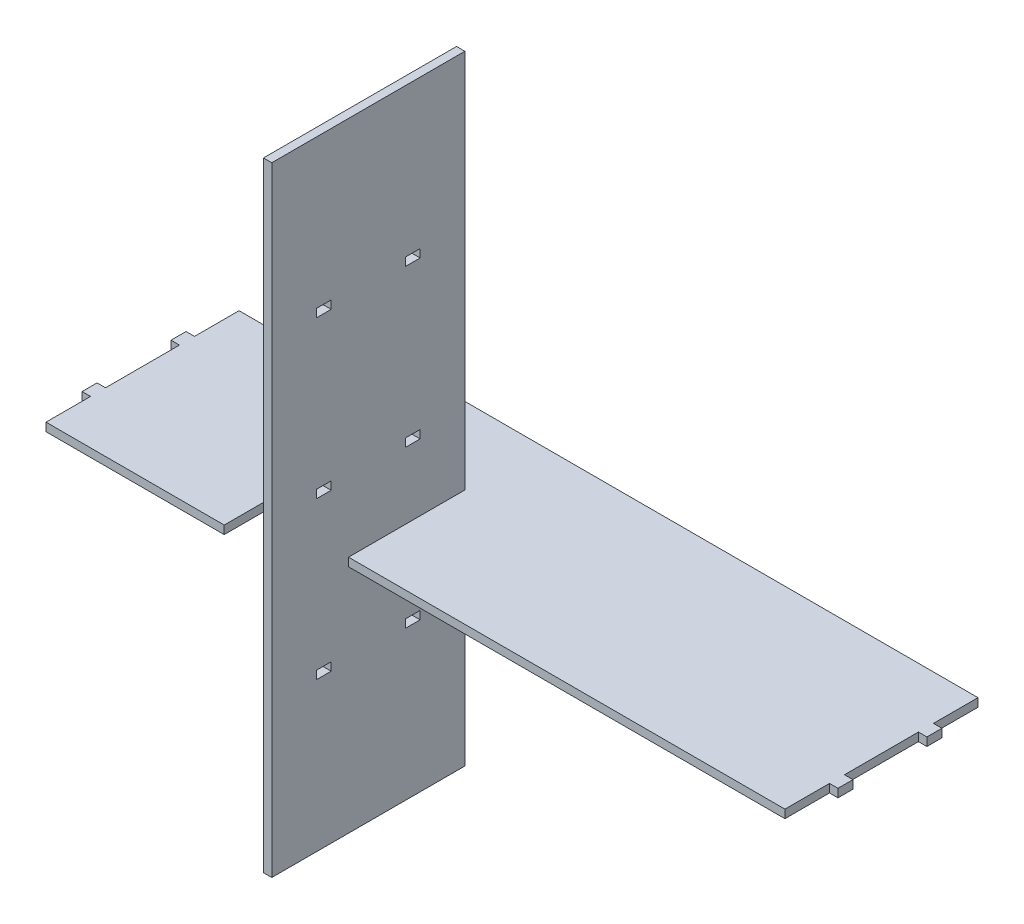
ISO-10303-21;
HEADER;
FILE_DESCRIPTION(('STEP AP214'),'2;1');
FILE_NAME('part.step','',(''),(''),'','','');
FILE_SCHEMA(('AUTOMOTIVE_DESIGN { 1 0 10303 214 1 1 1 1 }'));
ENDSEC;
DATA;
#1=APPLICATION_CONTEXT('core data for automotive mechanical design processes');
#2=APPLICATION_PROTOCOL_DEFINITION('international standard','automotive_design',2000,#1);
#3=PRODUCT_CONTEXT('',#1,'mechanical');
#4=PRODUCT('Part','Part','',(#3));
#5=PRODUCT_RELATED_PRODUCT_CATEGORY('part','',(#4));
#6=PRODUCT_DEFINITION_FORMATION('','',#4);
#7=PRODUCT_DEFINITION_CONTEXT('part definition',#1,'design');
#8=PRODUCT_DEFINITION('design','',#6,#7);
#9=PRODUCT_DEFINITION_SHAPE('','',#8);
#10=(LENGTH_UNIT() NAMED_UNIT(*) SI_UNIT(.MILLI.,.METRE.));
#11=(NAMED_UNIT(*) PLANE_ANGLE_UNIT() SI_UNIT($,.RADIAN.));
#12=(NAMED_UNIT(*) SI_UNIT($,.STERADIAN.) SOLID_ANGLE_UNIT());
#13=UNCERTAINTY_MEASURE_WITH_UNIT(LENGTH_MEASURE(1.E-05),#10,'distance_accuracy_value','');
#14=(GEOMETRIC_REPRESENTATION_CONTEXT(3) GLOBAL_UNCERTAINTY_ASSIGNED_CONTEXT((#13)) GLOBAL_UNIT_ASSIGNED_CONTEXT((#10,
#11,#12)) REPRESENTATION_CONTEXT('',''));
#15=CARTESIAN_POINT('',(0.,0.,0.));
#16=DIRECTION('',(0.,0.,1.));
#17=DIRECTION('',(1.,0.,0.));
#18=AXIS2_PLACEMENT_3D('',#15,#16,#17);
#19=CARTESIAN_POINT('',(-175.,5.6,-65.));
#20=DIRECTION('',(1.,0.,0.));
#21=DIRECTION('',(0.,0.,-1.));
#22=AXIS2_PLACEMENT_3D('',#19,#20,#21);
#23=PLANE('',#22);
#24=DIRECTION('',(0.,0.,1.));
#25=VECTOR('',#24,1.);
#26=CARTESIAN_POINT('',(-175.,0.,-65.));
#27=LINE('',#26,#25);
#28=CARTESIAN_POINT('',(-175.,0.,-65.));
#29=VERTEX_POINT('',#28);
#30=CARTESIAN_POINT('',(-175.,0.,-35.));
#31=VERTEX_POINT('',#30);
#32=EDGE_CURVE('E165',#29,#31,#27,.T.);
#33=ORIENTED_EDGE('',*,*,#32,.T.);
#34=DIRECTION('',(0.,-1.,0.));
#35=VECTOR('',#34,1.);
#36=CARTESIAN_POINT('',(-175.,5.6,-35.));
#37=LINE('',#36,#35);
#38=CARTESIAN_POINT('',(-175.,5.6,-35.));
#39=VERTEX_POINT('',#38);
#40=EDGE_CURVE('E12',#39,#31,#37,.T.);
#41=ORIENTED_EDGE('',*,*,#40,.F.);
#42=DIRECTION('',(0.,0.,1.));
#43=VECTOR('',#42,1.);
#44=CARTESIAN_POINT('',(-175.,5.6,-65.));
#45=LINE('',#44,#43);
#46=CARTESIAN_POINT('',(-175.,5.6,-65.));
#47=VERTEX_POINT('',#46);
#48=EDGE_CURVE('E187',#47,#39,#45,.T.);
#49=ORIENTED_EDGE('',*,*,#48,.F.);
#50=DIRECTION('',(0.,-1.,0.));
#51=VECTOR('',#50,1.);
#52=CARTESIAN_POINT('',(-175.,5.6,-65.));
#53=LINE('',#52,#51);
#54=EDGE_CURVE('E161',#47,#29,#53,.T.);
#55=ORIENTED_EDGE('',*,*,#54,.T.);
#56=EDGE_LOOP('',(#33,#41,#49,#55));
#57=FACE_BOUND('',#56,.T.);
#58=ADVANCED_FACE('F45',(#57),#23,.F.);
#59=CARTESIAN_POINT('',(-175.,5.6,-35.));
#60=DIRECTION('',(0.,0.,1.));
#61=DIRECTION('',(1.,0.,0.));
#62=AXIS2_PLACEMENT_3D('',#59,#60,#61);
#63=PLANE('',#62);
#64=DIRECTION('',(-1.,0.,0.));
#65=VECTOR('',#64,1.);
#66=CARTESIAN_POINT('',(-175.,0.,-35.));
#67=LINE('',#66,#65);
#68=CARTESIAN_POINT('',(-180.7,0.,-35.));
#69=VERTEX_POINT('',#68);
#70=EDGE_CURVE('E168',#31,#69,#67,.T.);
#71=ORIENTED_EDGE('',*,*,#70,.T.);
#72=DIRECTION('',(0.,-1.,0.));
#73=VECTOR('',#72,1.);
#74=CARTESIAN_POINT('',(-180.7,5.6,-35.));
#75=LINE('',#74,#73);
#76=CARTESIAN_POINT('',(-180.7,5.6,-35.));
#77=VERTEX_POINT('',#76);
#78=EDGE_CURVE('E53',#77,#69,#75,.T.);
#79=ORIENTED_EDGE('',*,*,#78,.F.);
#80=DIRECTION('',(-1.,0.,0.));
#81=VECTOR('',#80,1.);
#82=CARTESIAN_POINT('',(-175.,5.6,-35.));
#83=LINE('',#82,#81);
#84=EDGE_CURVE('E116',#39,#77,#83,.T.);
#85=ORIENTED_EDGE('',*,*,#84,.F.);
#86=ORIENTED_EDGE('',*,*,#40,.T.);
#87=EDGE_LOOP('',(#71,#79,#85,#86));
#88=FACE_BOUND('',#87,.T.);
#89=ADVANCED_FACE('F265',(#88),#63,.F.);
#90=CARTESIAN_POINT('',(-180.7,5.6,-35.));
#91=DIRECTION('',(1.,0.,0.));
#92=DIRECTION('',(0.,0.,-1.));
#93=AXIS2_PLACEMENT_3D('',#90,#91,#92);
#94=PLANE('',#93);
#95=DIRECTION('',(0.,0.,1.));
#96=VECTOR('',#95,1.);
#97=CARTESIAN_POINT('',(-180.7,0.,-35.));
#98=LINE('',#97,#96);
#99=CARTESIAN_POINT('',(-180.7,0.,-24.9));
#100=VERTEX_POINT('',#99);
#101=EDGE_CURVE('E170',#69,#100,#98,.T.);
#102=ORIENTED_EDGE('',*,*,#101,.T.);
#103=DIRECTION('',(0.,-1.,0.));
#104=VECTOR('',#103,1.);
#105=CARTESIAN_POINT('',(-180.7,5.6,-24.9));
#106=LINE('',#105,#104);
#107=CARTESIAN_POINT('',(-180.7,5.6,-24.9));
#108=VERTEX_POINT('',#107);
#109=EDGE_CURVE('E206',#108,#100,#106,.T.);
#110=ORIENTED_EDGE('',*,*,#109,.F.);
#111=DIRECTION('',(0.,0.,1.));
#112=VECTOR('',#111,1.);
#113=CARTESIAN_POINT('',(-180.7,5.6,-35.));
#114=LINE('',#113,#112);
#115=EDGE_CURVE('E214',#77,#108,#114,.T.);
#116=ORIENTED_EDGE('',*,*,#115,.F.);
#117=ORIENTED_EDGE('',*,*,#78,.T.);
#118=EDGE_LOOP('',(#102,#110,#116,#117));
#119=FACE_BOUND('',#118,.T.);
#120=ADVANCED_FACE('F212',(#119),#94,.F.);
#121=CARTESIAN_POINT('',(-180.7,5.6,-24.9));
#122=DIRECTION('',(0.,0.,-1.));
#123=DIRECTION('',(-1.,0.,0.));
#124=AXIS2_PLACEMENT_3D('',#121,#122,#123);
#125=PLANE('',#124);
#126=DIRECTION('',(1.,0.,0.));
#127=VECTOR('',#126,1.);
#128=CARTESIAN_POINT('',(-180.7,0.,-24.9));
#129=LINE('',#128,#127);
#130=CARTESIAN_POINT('',(-175.,0.,-24.9));
#131=VERTEX_POINT('',#130);
#132=EDGE_CURVE('E172',#100,#131,#129,.T.);
#133=ORIENTED_EDGE('',*,*,#132,.T.);
#134=DIRECTION('',(0.,-1.,0.));
#135=VECTOR('',#134,1.);
#136=CARTESIAN_POINT('',(-175.,5.6,-24.9));
#137=LINE('',#136,#135);
#138=CARTESIAN_POINT('',(-175.,5.6,-24.9));
#139=VERTEX_POINT('',#138);
#140=EDGE_CURVE('E203',#139,#131,#137,.T.);
#141=ORIENTED_EDGE('',*,*,#140,.F.);
#142=DIRECTION('',(1.,0.,0.));
#143=VECTOR('',#142,1.);
#144=CARTESIAN_POINT('',(-180.7,5.6,-24.9));
#145=LINE('',#144,#143);
#146=EDGE_CURVE('E232',#108,#139,#145,.T.);
#147=ORIENTED_EDGE('',*,*,#146,.F.);
#148=ORIENTED_EDGE('',*,*,#109,.T.);
#149=EDGE_LOOP('',(#133,#141,#147,#148));
#150=FACE_BOUND('',#149,.T.);
#151=ADVANCED_FACE('F223',(#150),#125,.F.);
#152=CARTESIAN_POINT('',(-175.,5.6,-24.9));
#153=DIRECTION('',(1.,0.,0.));
#154=DIRECTION('',(0.,0.,-1.));
#155=AXIS2_PLACEMENT_3D('',#152,#153,#154);
#156=PLANE('',#155);
#157=DIRECTION('',(0.,0.,1.));
#158=VECTOR('',#157,1.);
#159=CARTESIAN_POINT('',(-175.,0.,-24.9));
#160=LINE('',#159,#158);
#161=CARTESIAN_POINT('',(-175.,0.,24.9));
#162=VERTEX_POINT('',#161);
#163=EDGE_CURVE('E174',#131,#162,#160,.T.);
#164=ORIENTED_EDGE('',*,*,#163,.T.);
#165=DIRECTION('',(0.,-1.,0.));
#166=VECTOR('',#165,1.);
#167=CARTESIAN_POINT('',(-175.,5.6,24.9));
#168=LINE('',#167,#166);
#169=CARTESIAN_POINT('',(-175.,5.6,24.9));
#170=VERTEX_POINT('',#169);
#171=EDGE_CURVE('E200',#170,#162,#168,.T.);
#172=ORIENTED_EDGE('',*,*,#171,.F.);
#173=DIRECTION('',(0.,0.,1.));
#174=VECTOR('',#173,1.);
#175=CARTESIAN_POINT('',(-175.,5.6,-24.9));
#176=LINE('',#175,#174);
#177=EDGE_CURVE('E229',#139,#170,#176,.T.);
#178=ORIENTED_EDGE('',*,*,#177,.F.);
#179=ORIENTED_EDGE('',*,*,#140,.T.);
#180=EDGE_LOOP('',(#164,#172,#178,#179));
#181=FACE_BOUND('',#180,.T.);
#182=ADVANCED_FACE('F227',(#181),#156,.F.);
#183=CARTESIAN_POINT('',(-180.7,5.6,24.9));
#184=DIRECTION('',(0.,0.,1.));
#185=DIRECTION('',(1.,0.,0.));
#186=AXIS2_PLACEMENT_3D('',#183,#184,#185);
#187=PLANE('',#186);
#188=DIRECTION('',(-1.,0.,0.));
#189=VECTOR('',#188,1.);
#190=CARTESIAN_POINT('',(-180.7,0.,24.9));
#191=LINE('',#190,#189);
#192=CARTESIAN_POINT('',(-180.7,0.,24.9));
#193=VERTEX_POINT('',#192);
#194=EDGE_CURVE('E176',#162,#193,#191,.T.);
#195=ORIENTED_EDGE('',*,*,#194,.T.);
#196=DIRECTION('',(0.,-1.,0.));
#197=VECTOR('',#196,1.);
#198=CARTESIAN_POINT('',(-180.7,5.6,24.9));
#199=LINE('',#198,#197);
#200=CARTESIAN_POINT('',(-180.7,5.6,24.9));
#201=VERTEX_POINT('',#200);
#202=EDGE_CURVE('E197',#201,#193,#199,.T.);
#203=ORIENTED_EDGE('',*,*,#202,.F.);
#204=DIRECTION('',(-1.,0.,0.));
#205=VECTOR('',#204,1.);
#206=CARTESIAN_POINT('',(-180.7,5.6,24.9));
#207=LINE('',#206,#205);
#208=EDGE_CURVE('E231',#170,#201,#207,.T.);
#209=ORIENTED_EDGE('',*,*,#208,.F.);
#210=ORIENTED_EDGE('',*,*,#171,.T.);
#211=EDGE_LOOP('',(#195,#203,#209,#210));
#212=FACE_BOUND('',#211,.T.);
#213=ADVANCED_FACE('F278',(#212),#187,.F.);
#214=CARTESIAN_POINT('',(-180.7,5.6,35.));
#215=DIRECTION('',(1.,0.,0.));
#216=DIRECTION('',(0.,0.,-1.));
#217=AXIS2_PLACEMENT_3D('',#214,#215,#216);
#218=PLANE('',#217);
#219=DIRECTION('',(0.,0.,1.));
#220=VECTOR('',#219,1.);
#221=CARTESIAN_POINT('',(-180.7,0.,35.));
#222=LINE('',#221,#220);
#223=CARTESIAN_POINT('',(-180.7,0.,35.));
#224=VERTEX_POINT('',#223);
#225=EDGE_CURVE('E178',#193,#224,#222,.T.);
#226=ORIENTED_EDGE('',*,*,#225,.T.);
#227=DIRECTION('',(0.,-1.,0.));
#228=VECTOR('',#227,1.);
#229=CARTESIAN_POINT('',(-180.7,5.6,35.));
#230=LINE('',#229,#228);
#231=CARTESIAN_POINT('',(-180.7,5.6,35.));
#232=VERTEX_POINT('',#231);
#233=EDGE_CURVE('E194',#232,#224,#230,.T.);
#234=ORIENTED_EDGE('',*,*,#233,.F.);
#235=DIRECTION('',(0.,0.,1.));
#236=VECTOR('',#235,1.);
#237=CARTESIAN_POINT('',(-180.7,5.6,35.));
#238=LINE('',#237,#236);
#239=EDGE_CURVE('E234',#201,#232,#238,.T.);
#240=ORIENTED_EDGE('',*,*,#239,.F.);
#241=ORIENTED_EDGE('',*,*,#202,.T.);
#242=EDGE_LOOP('',(#226,#234,#240,#241));
#243=FACE_BOUND('',#242,.T.);
#244=ADVANCED_FACE('F281',(#243),#218,.F.);
#245=CARTESIAN_POINT('',(-175.,5.6,35.));
#246=DIRECTION('',(0.,0.,-1.));
#247=DIRECTION('',(-1.,0.,0.));
#248=AXIS2_PLACEMENT_3D('',#245,#246,#247);
#249=PLANE('',#248);
#250=DIRECTION('',(1.,0.,0.));
#251=VECTOR('',#250,1.);
#252=CARTESIAN_POINT('',(-175.,0.,35.));
#253=LINE('',#252,#251);
#254=CARTESIAN_POINT('',(-175.,0.,35.));
#255=VERTEX_POINT('',#254);
#256=EDGE_CURVE('E180',#224,#255,#253,.T.);
#257=ORIENTED_EDGE('',*,*,#256,.T.);
#258=DIRECTION('',(0.,-1.,0.));
#259=VECTOR('',#258,1.);
#260=CARTESIAN_POINT('',(-175.,5.6,35.));
#261=LINE('',#260,#259);
#262=CARTESIAN_POINT('',(-175.,5.6,35.));
#263=VERTEX_POINT('',#262);
#264=EDGE_CURVE('E191',#263,#255,#261,.T.);
#265=ORIENTED_EDGE('',*,*,#264,.F.);
#266=DIRECTION('',(1.,0.,0.));
#267=VECTOR('',#266,1.);
#268=CARTESIAN_POINT('',(-175.,5.6,35.));
#269=LINE('',#268,#267);
#270=EDGE_CURVE('E240',#232,#263,#269,.T.);
#271=ORIENTED_EDGE('',*,*,#270,.F.);
#272=ORIENTED_EDGE('',*,*,#233,.T.);
#273=EDGE_LOOP('',(#257,#265,#271,#272));
#274=FACE_BOUND('',#273,.T.);
#275=ADVANCED_FACE('F246',(#274),#249,.F.);
#276=CARTESIAN_POINT('',(-175.,5.6,35.));
#277=DIRECTION('',(1.,0.,0.));
#278=DIRECTION('',(0.,0.,-1.));
#279=AXIS2_PLACEMENT_3D('',#276,#277,#278);
#280=PLANE('',#279);
#281=DIRECTION('',(0.,0.,1.));
#282=VECTOR('',#281,1.);
#283=CARTESIAN_POINT('',(-175.,0.,35.));
#284=LINE('',#283,#282);
#285=CARTESIAN_POINT('',(-175.,0.,65.));
#286=VERTEX_POINT('',#285);
#287=EDGE_CURVE('E182',#255,#286,#284,.T.);
#288=ORIENTED_EDGE('',*,*,#287,.T.);
#289=DIRECTION('',(0.,-1.,0.));
#290=VECTOR('',#289,1.);
#291=CARTESIAN_POINT('',(-175.,5.6,65.));
#292=LINE('',#291,#290);
#293=CARTESIAN_POINT('',(-175.,5.6,65.));
#294=VERTEX_POINT('',#293);
#295=EDGE_CURVE('E156',#294,#286,#292,.T.);
#296=ORIENTED_EDGE('',*,*,#295,.F.);
#297=DIRECTION('',(0.,0.,1.));
#298=VECTOR('',#297,1.);
#299=CARTESIAN_POINT('',(-175.,5.6,35.));
#300=LINE('',#299,#298);
#301=EDGE_CURVE('E147',#263,#294,#300,.T.);
#302=ORIENTED_EDGE('',*,*,#301,.F.);
#303=ORIENTED_EDGE('',*,*,#264,.T.);
#304=EDGE_LOOP('',(#288,#296,#302,#303));
#305=FACE_BOUND('',#304,.T.);
#306=ADVANCED_FACE('F250',(#305),#280,.F.);
#307=CARTESIAN_POINT('',(-175.,5.6,65.));
#308=DIRECTION('',(0.,0.,-1.));
#309=DIRECTION('',(-1.,0.,0.));
#310=AXIS2_PLACEMENT_3D('',#307,#308,#309);
#311=PLANE('',#310);
#312=DIRECTION('',(1.,0.,0.));
#313=VECTOR('',#312,1.);
#314=CARTESIAN_POINT('',(-175.,0.,65.));
#315=LINE('',#314,#313);
#316=CARTESIAN_POINT('',(-55.,0.,65.));
#317=VERTEX_POINT('',#316);
#318=EDGE_CURVE('E155',#286,#317,#315,.T.);
#319=ORIENTED_EDGE('',*,*,#318,.T.);
#320=DIRECTION('',(0.,-1.,0.));
#321=VECTOR('',#320,1.);
#322=CARTESIAN_POINT('',(-55.,5.6,65.));
#323=LINE('',#322,#321);
#324=CARTESIAN_POINT('',(-55.,5.6,65.));
#325=VERTEX_POINT('',#324);
#326=EDGE_CURVE('E152',#325,#317,#323,.T.);
#327=ORIENTED_EDGE('',*,*,#326,.F.);
#328=DIRECTION('',(1.,0.,0.));
#329=VECTOR('',#328,1.);
#330=CARTESIAN_POINT('',(-175.,5.6,65.));
#331=LINE('',#330,#329);
#332=EDGE_CURVE('E141',#294,#325,#331,.T.);
#333=ORIENTED_EDGE('',*,*,#332,.F.);
#334=ORIENTED_EDGE('',*,*,#295,.T.);
#335=EDGE_LOOP('',(#319,#327,#333,#334));
#336=FACE_BOUND('',#335,.T.);
#337=ADVANCED_FACE('F153',(#336),#311,.F.);
#338=CARTESIAN_POINT('',(-55.,5.6,-65.));
#339=DIRECTION('',(-1.,0.,0.));
#340=DIRECTION('',(0.,0.,1.));
#341=AXIS2_PLACEMENT_3D('',#338,#339,#340);
#342=PLANE('',#341);
#343=DIRECTION('',(0.,0.,-1.));
#344=VECTOR('',#343,1.);
#345=CARTESIAN_POINT('',(-55.,0.,-65.));
#346=LINE('',#345,#344);
#347=CARTESIAN_POINT('',(-55.,0.,-65.));
#348=VERTEX_POINT('',#347);
#349=EDGE_CURVE('E102',#317,#348,#346,.T.);
#350=ORIENTED_EDGE('',*,*,#349,.T.);
#351=DIRECTION('',(0.,-1.,0.));
#352=VECTOR('',#351,1.);
#353=CARTESIAN_POINT('',(-55.,5.6,-65.));
#354=LINE('',#353,#352);
#355=CARTESIAN_POINT('',(-55.,5.6,-65.));
#356=VERTEX_POINT('',#355);
#357=EDGE_CURVE('E157',#356,#348,#354,.T.);
#358=ORIENTED_EDGE('',*,*,#357,.F.);
#359=DIRECTION('',(0.,0.,-1.));
#360=VECTOR('',#359,1.);
#361=CARTESIAN_POINT('',(-55.,5.6,-65.));
#362=LINE('',#361,#360);
#363=EDGE_CURVE('E145',#325,#356,#362,.T.);
#364=ORIENTED_EDGE('',*,*,#363,.F.);
#365=ORIENTED_EDGE('',*,*,#326,.T.);
#366=EDGE_LOOP('',(#350,#358,#364,#365));
#367=FACE_BOUND('',#366,.T.);
#368=ADVANCED_FACE('F159',(#367),#342,.F.);
#369=CARTESIAN_POINT('',(-175.,5.6,-65.));
#370=DIRECTION('',(0.,0.,1.));
#371=DIRECTION('',(1.,0.,0.));
#372=AXIS2_PLACEMENT_3D('',#369,#370,#371);
#373=PLANE('',#372);
#374=DIRECTION('',(-1.,0.,0.));
#375=VECTOR('',#374,1.);
#376=CARTESIAN_POINT('',(-175.,0.,-65.));
#377=LINE('',#376,#375);
#378=EDGE_CURVE('E108',#348,#29,#377,.T.);
#379=ORIENTED_EDGE('',*,*,#378,.T.);
#380=ORIENTED_EDGE('',*,*,#54,.F.);
#381=DIRECTION('',(-1.,0.,0.));
#382=VECTOR('',#381,1.);
#383=CARTESIAN_POINT('',(-175.,5.6,-65.));
#384=LINE('',#383,#382);
#385=EDGE_CURVE('E61',#356,#47,#384,.T.);
#386=ORIENTED_EDGE('',*,*,#385,.F.);
#387=ORIENTED_EDGE('',*,*,#357,.T.);
#388=EDGE_LOOP('',(#379,#380,#386,#387));
#389=FACE_BOUND('',#388,.T.);
#390=ADVANCED_FACE('F254',(#389),#373,.F.);
#391=CARTESIAN_POINT('',(0.,5.6,0.));
#392=DIRECTION('',(0.,-1.,0.));
#393=DIRECTION('',(0.,0.,-1.));
#394=AXIS2_PLACEMENT_3D('',#391,#392,#393);
#395=PLANE('',#394);
#396=ORIENTED_EDGE('',*,*,#48,.T.);
#397=ORIENTED_EDGE('',*,*,#84,.T.);
#398=ORIENTED_EDGE('',*,*,#115,.T.);
#399=ORIENTED_EDGE('',*,*,#146,.T.);
#400=ORIENTED_EDGE('',*,*,#177,.T.);
#401=ORIENTED_EDGE('',*,*,#208,.T.);
#402=ORIENTED_EDGE('',*,*,#239,.T.);
#403=ORIENTED_EDGE('',*,*,#270,.T.);
#404=ORIENTED_EDGE('',*,*,#301,.T.);
#405=ORIENTED_EDGE('',*,*,#332,.T.);
#406=ORIENTED_EDGE('',*,*,#363,.T.);
#407=ORIENTED_EDGE('',*,*,#385,.T.);
#408=EDGE_LOOP('',(#396,#397,#398,#399,#400,#401,#402,#403,#404,#405,#406,#407));
#409=FACE_BOUND('',#408,.T.);
#410=ADVANCED_FACE('F143',(#409),#395,.F.);
#411=CARTESIAN_POINT('',(0.,0.,0.));
#412=DIRECTION('',(0.,-1.,0.));
#413=DIRECTION('',(0.,0.,-1.));
#414=AXIS2_PLACEMENT_3D('',#411,#412,#413);
#415=PLANE('',#414);
#416=ORIENTED_EDGE('',*,*,#32,.F.);
#417=ORIENTED_EDGE('',*,*,#378,.F.);
#418=ORIENTED_EDGE('',*,*,#349,.F.);
#419=ORIENTED_EDGE('',*,*,#318,.F.);
#420=ORIENTED_EDGE('',*,*,#287,.F.);
#421=ORIENTED_EDGE('',*,*,#256,.F.);
#422=ORIENTED_EDGE('',*,*,#225,.F.);
#423=ORIENTED_EDGE('',*,*,#194,.F.);
#424=ORIENTED_EDGE('',*,*,#163,.F.);
#425=ORIENTED_EDGE('',*,*,#132,.F.);
#426=ORIENTED_EDGE('',*,*,#101,.F.);
#427=ORIENTED_EDGE('',*,*,#70,.F.);
#428=EDGE_LOOP('',(#416,#417,#418,#419,#420,#421,#422,#423,#424,#425,#426,#427));
#429=FACE_BOUND('',#428,.T.);
#430=ADVANCED_FACE('F218',(#429),#415,.T.);
#431=CLOSED_SHELL('',(#58,#89,#120,#151,#182,#213,#244,#275,#306,#337,#368,#390,#410,#430));
#432=MANIFOLD_SOLID_BREP('B2_NOT_SHOWN',#431);
#433=CARTESIAN_POINT('',(-50.557601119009,5.6,-88.118559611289));
#434=DIRECTION('',(1.,0.,0.));
#435=DIRECTION('',(0.,0.,-1.));
#436=AXIS2_PLACEMENT_3D('',#433,#434,#435);
#437=PLANE('',#436);
#438=DIRECTION('',(0.,0.,1.));
#439=VECTOR('',#438,1.);
#440=CARTESIAN_POINT('',(-50.557601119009,0.,-88.118559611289));
#441=LINE('',#440,#439);
#442=CARTESIAN_POINT('',(-50.557601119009,0.,-88.118559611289));
#443=VERTEX_POINT('',#442);
#444=CARTESIAN_POINT('',(-50.557601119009,0.,-58.118559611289));
#445=VERTEX_POINT('',#444);
#446=EDGE_CURVE('E553',#443,#445,#441,.T.);
#447=ORIENTED_EDGE('',*,*,#446,.T.);
#448=DIRECTION('',(0.,-1.,0.));
#449=VECTOR('',#448,1.);
#450=CARTESIAN_POINT('',(-50.557601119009,5.6,-58.118559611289));
#451=LINE('',#450,#449);
#452=CARTESIAN_POINT('',(-50.557601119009,5.6,-58.118559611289));
#453=VERTEX_POINT('',#452);
#454=EDGE_CURVE('E43',#453,#445,#451,.T.);
#455=ORIENTED_EDGE('',*,*,#454,.F.);
#456=DIRECTION('',(0.,0.,1.));
#457=VECTOR('',#456,1.);
#458=CARTESIAN_POINT('',(-50.557601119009,5.6,-88.118559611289));
#459=LINE('',#458,#457);
#460=CARTESIAN_POINT('',(-50.557601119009,5.6,-88.118559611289));
#461=VERTEX_POINT('',#460);
#462=EDGE_CURVE('E591',#461,#453,#459,.T.);
#463=ORIENTED_EDGE('',*,*,#462,.F.);
#464=DIRECTION('',(0.,-1.,0.));
#465=VECTOR('',#464,1.);
#466=CARTESIAN_POINT('',(-50.557601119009,5.6,-88.118559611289));
#467=LINE('',#466,#465);
#468=EDGE_CURVE('E549',#461,#443,#467,.T.);
#469=ORIENTED_EDGE('',*,*,#468,.T.);
#470=EDGE_LOOP('',(#447,#455,#463,#469));
#471=FACE_BOUND('',#470,.T.);
#472=ADVANCED_FACE('F385',(#471),#437,.F.);
#473=CARTESIAN_POINT('',(-50.557601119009,5.6,-58.118559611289));
#474=DIRECTION('',(0.,0.,1.));
#475=DIRECTION('',(1.,0.,0.));
#476=AXIS2_PLACEMENT_3D('',#473,#474,#475);
#477=PLANE('',#476);
#478=DIRECTION('',(-1.,0.,0.));
#479=VECTOR('',#478,1.);
#480=CARTESIAN_POINT('',(-50.557601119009,0.,-58.118559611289));
#481=LINE('',#480,#479);
#482=CARTESIAN_POINT('',(-56.257601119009,0.,-58.118559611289));
#483=VERTEX_POINT('',#482);
#484=EDGE_CURVE('E556',#445,#483,#481,.T.);
#485=ORIENTED_EDGE('',*,*,#484,.T.);
#486=DIRECTION('',(0.,-1.,0.));
#487=VECTOR('',#486,1.);
#488=CARTESIAN_POINT('',(-56.257601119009,5.6,-58.118559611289));
#489=LINE('',#488,#487);
#490=CARTESIAN_POINT('',(-56.257601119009,5.6,-58.118559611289));
#491=VERTEX_POINT('',#490);
#492=EDGE_CURVE('E393',#491,#483,#489,.T.);
#493=ORIENTED_EDGE('',*,*,#492,.F.);
#494=DIRECTION('',(-1.,0.,0.));
#495=VECTOR('',#494,1.);
#496=CARTESIAN_POINT('',(-50.557601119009,5.6,-58.118559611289));
#497=LINE('',#496,#495);
#498=EDGE_CURVE('E480',#453,#491,#497,.T.);
#499=ORIENTED_EDGE('',*,*,#498,.F.);
#500=ORIENTED_EDGE('',*,*,#454,.T.);
#501=EDGE_LOOP('',(#485,#493,#499,#500));
#502=FACE_BOUND('',#501,.T.);
#503=ADVANCED_FACE('F709',(#502),#477,.F.);
#504=CARTESIAN_POINT('',(-56.257601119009,5.6,-58.118559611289));
#505=DIRECTION('',(1.,0.,0.));
#506=DIRECTION('',(0.,0.,-1.));
#507=AXIS2_PLACEMENT_3D('',#504,#505,#506);
#508=PLANE('',#507);
#509=DIRECTION('',(0.,0.,1.));
#510=VECTOR('',#509,1.);
#511=CARTESIAN_POINT('',(-56.257601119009,0.,-58.118559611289));
#512=LINE('',#511,#510);
#513=CARTESIAN_POINT('',(-56.257601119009,0.,-48.018559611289));
#514=VERTEX_POINT('',#513);
#515=EDGE_CURVE('E558',#483,#514,#512,.T.);
#516=ORIENTED_EDGE('',*,*,#515,.T.);
#517=DIRECTION('',(0.,-1.,0.));
#518=VECTOR('',#517,1.);
#519=CARTESIAN_POINT('',(-56.257601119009,5.6,-48.018559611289));
#520=LINE('',#519,#518);
#521=CARTESIAN_POINT('',(-56.257601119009,5.6,-48.018559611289));
#522=VERTEX_POINT('',#521);
#523=EDGE_CURVE('E634',#522,#514,#520,.T.);
#524=ORIENTED_EDGE('',*,*,#523,.F.);
#525=DIRECTION('',(0.,0.,1.));
#526=VECTOR('',#525,1.);
#527=CARTESIAN_POINT('',(-56.257601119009,5.6,-58.118559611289));
#528=LINE('',#527,#526);
#529=EDGE_CURVE('E642',#491,#522,#528,.T.);
#530=ORIENTED_EDGE('',*,*,#529,.F.);
#531=ORIENTED_EDGE('',*,*,#492,.T.);
#532=EDGE_LOOP('',(#516,#524,#530,#531));
#533=FACE_BOUND('',#532,.T.);
#534=ADVANCED_FACE('F640',(#533),#508,.F.);
#535=CARTESIAN_POINT('',(-56.257601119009,5.6,-48.018559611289));
#536=DIRECTION('',(0.,0.,-1.));
#537=DIRECTION('',(-1.,0.,0.));
#538=AXIS2_PLACEMENT_3D('',#535,#536,#537);
#539=PLANE('',#538);
#540=DIRECTION('',(1.,0.,0.));
#541=VECTOR('',#540,1.);
#542=CARTESIAN_POINT('',(-56.257601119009,0.,-48.018559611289));
#543=LINE('',#542,#541);
#544=CARTESIAN_POINT('',(-50.557601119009,0.,-48.018559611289));
#545=VERTEX_POINT('',#544);
#546=EDGE_CURVE('E560',#514,#545,#543,.T.);
#547=ORIENTED_EDGE('',*,*,#546,.T.);
#548=DIRECTION('',(0.,-1.,0.));
#549=VECTOR('',#548,1.);
#550=CARTESIAN_POINT('',(-50.557601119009,5.6,-48.018559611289));
#551=LINE('',#550,#549);
#552=CARTESIAN_POINT('',(-50.557601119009,5.6,-48.018559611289));
#553=VERTEX_POINT('',#552);
#554=EDGE_CURVE('E631',#553,#545,#551,.T.);
#555=ORIENTED_EDGE('',*,*,#554,.F.);
#556=DIRECTION('',(1.,0.,0.));
#557=VECTOR('',#556,1.);
#558=CARTESIAN_POINT('',(-56.257601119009,5.6,-48.018559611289));
#559=LINE('',#558,#557);
#560=EDGE_CURVE('E660',#522,#553,#559,.T.);
#561=ORIENTED_EDGE('',*,*,#560,.F.);
#562=ORIENTED_EDGE('',*,*,#523,.T.);
#563=EDGE_LOOP('',(#547,#555,#561,#562));
#564=FACE_BOUND('',#563,.T.);
#565=ADVANCED_FACE('F651',(#564),#539,.F.);
#566=CARTESIAN_POINT('',(-50.557601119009,5.6,-48.018559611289));
#567=DIRECTION('',(1.,0.,0.));
#568=DIRECTION('',(0.,0.,-1.));
#569=AXIS2_PLACEMENT_3D('',#566,#567,#568);
#570=PLANE('',#569);
#571=DIRECTION('',(0.,0.,1.));
#572=VECTOR('',#571,1.);
#573=CARTESIAN_POINT('',(-50.557601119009,0.,-48.018559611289));
#574=LINE('',#573,#572);
#575=CARTESIAN_POINT('',(-50.557601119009,0.,1.78144038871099));
#576=VERTEX_POINT('',#575);
#577=EDGE_CURVE('E562',#545,#576,#574,.T.);
#578=ORIENTED_EDGE('',*,*,#577,.T.);
#579=DIRECTION('',(0.,-1.,0.));
#580=VECTOR('',#579,1.);
#581=CARTESIAN_POINT('',(-50.557601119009,5.6,1.78144038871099));
#582=LINE('',#581,#580);
#583=CARTESIAN_POINT('',(-50.557601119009,5.6,1.78144038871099));
#584=VERTEX_POINT('',#583);
#585=EDGE_CURVE('E628',#584,#576,#582,.T.);
#586=ORIENTED_EDGE('',*,*,#585,.F.);
#587=DIRECTION('',(0.,0.,1.));
#588=VECTOR('',#587,1.);
#589=CARTESIAN_POINT('',(-50.557601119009,5.6,-48.018559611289));
#590=LINE('',#589,#588);
#591=EDGE_CURVE('E657',#553,#584,#590,.T.);
#592=ORIENTED_EDGE('',*,*,#591,.F.);
#593=ORIENTED_EDGE('',*,*,#554,.T.);
#594=EDGE_LOOP('',(#578,#586,#592,#593));
#595=FACE_BOUND('',#594,.T.);
#596=ADVANCED_FACE('F655',(#595),#570,.F.);
#597=CARTESIAN_POINT('',(-56.257601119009,5.6,1.78144038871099));
#598=DIRECTION('',(0.,0.,1.));
#599=DIRECTION('',(1.,0.,0.));
#600=AXIS2_PLACEMENT_3D('',#597,#598,#599);
#601=PLANE('',#600);
#602=DIRECTION('',(-1.,0.,0.));
#603=VECTOR('',#602,1.);
#604=CARTESIAN_POINT('',(-56.257601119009,0.,1.78144038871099));
#605=LINE('',#604,#603);
#606=CARTESIAN_POINT('',(-56.257601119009,0.,1.78144038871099));
#607=VERTEX_POINT('',#606);
#608=EDGE_CURVE('E564',#576,#607,#605,.T.);
#609=ORIENTED_EDGE('',*,*,#608,.T.);
#610=DIRECTION('',(0.,-1.,0.));
#611=VECTOR('',#610,1.);
#612=CARTESIAN_POINT('',(-56.257601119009,5.6,1.78144038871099));
#613=LINE('',#612,#611);
#614=CARTESIAN_POINT('',(-56.257601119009,5.6,1.78144038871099));
#615=VERTEX_POINT('',#614);
#616=EDGE_CURVE('E625',#615,#607,#613,.T.);
#617=ORIENTED_EDGE('',*,*,#616,.F.);
#618=DIRECTION('',(-1.,0.,0.));
#619=VECTOR('',#618,1.);
#620=CARTESIAN_POINT('',(-56.257601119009,5.6,1.78144038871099));
#621=LINE('',#620,#619);
#622=EDGE_CURVE('E659',#584,#615,#621,.T.);
#623=ORIENTED_EDGE('',*,*,#622,.F.);
#624=ORIENTED_EDGE('',*,*,#585,.T.);
#625=EDGE_LOOP('',(#609,#617,#623,#624));
#626=FACE_BOUND('',#625,.T.);
#627=ADVANCED_FACE('F722',(#626),#601,.F.);
#628=CARTESIAN_POINT('',(-56.257601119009,5.6,11.881440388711));
#629=DIRECTION('',(1.,0.,0.));
#630=DIRECTION('',(0.,0.,-1.));
#631=AXIS2_PLACEMENT_3D('',#628,#629,#630);
#632=PLANE('',#631);
#633=DIRECTION('',(0.,0.,1.));
#634=VECTOR('',#633,1.);
#635=CARTESIAN_POINT('',(-56.257601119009,0.,11.881440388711));
#636=LINE('',#635,#634);
#637=CARTESIAN_POINT('',(-56.257601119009,0.,11.881440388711));
#638=VERTEX_POINT('',#637);
#639=EDGE_CURVE('E566',#607,#638,#636,.T.);
#640=ORIENTED_EDGE('',*,*,#639,.T.);
#641=DIRECTION('',(0.,-1.,0.));
#642=VECTOR('',#641,1.);
#643=CARTESIAN_POINT('',(-56.257601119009,5.6,11.881440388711));
#644=LINE('',#643,#642);
#645=CARTESIAN_POINT('',(-56.257601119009,5.6,11.881440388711));
#646=VERTEX_POINT('',#645);
#647=EDGE_CURVE('E622',#646,#638,#644,.T.);
#648=ORIENTED_EDGE('',*,*,#647,.F.);
#649=DIRECTION('',(0.,0.,1.));
#650=VECTOR('',#649,1.);
#651=CARTESIAN_POINT('',(-56.257601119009,5.6,11.881440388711));
#652=LINE('',#651,#650);
#653=EDGE_CURVE('E662',#615,#646,#652,.T.);
#654=ORIENTED_EDGE('',*,*,#653,.F.);
#655=ORIENTED_EDGE('',*,*,#616,.T.);
#656=EDGE_LOOP('',(#640,#648,#654,#655));
#657=FACE_BOUND('',#656,.T.);
#658=ADVANCED_FACE('F725',(#657),#632,.F.);
#659=CARTESIAN_POINT('',(-50.557601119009,5.6,11.881440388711));
#660=DIRECTION('',(0.,0.,-1.));
#661=DIRECTION('',(-1.,0.,0.));
#662=AXIS2_PLACEMENT_3D('',#659,#660,#661);
#663=PLANE('',#662);
#664=DIRECTION('',(1.,0.,0.));
#665=VECTOR('',#664,1.);
#666=CARTESIAN_POINT('',(-50.557601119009,0.,11.881440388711));
#667=LINE('',#666,#665);
#668=CARTESIAN_POINT('',(-50.557601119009,0.,11.881440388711));
#669=VERTEX_POINT('',#668);
#670=EDGE_CURVE('E568',#638,#669,#667,.T.);
#671=ORIENTED_EDGE('',*,*,#670,.T.);
#672=DIRECTION('',(0.,-1.,0.));
#673=VECTOR('',#672,1.);
#674=CARTESIAN_POINT('',(-50.557601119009,5.6,11.881440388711));
#675=LINE('',#674,#673);
#676=CARTESIAN_POINT('',(-50.557601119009,5.6,11.881440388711));
#677=VERTEX_POINT('',#676);
#678=EDGE_CURVE('E619',#677,#669,#675,.T.);
#679=ORIENTED_EDGE('',*,*,#678,.F.);
#680=DIRECTION('',(1.,0.,0.));
#681=VECTOR('',#680,1.);
#682=CARTESIAN_POINT('',(-50.557601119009,5.6,11.881440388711));
#683=LINE('',#682,#681);
#684=EDGE_CURVE('E668',#646,#677,#683,.T.);
#685=ORIENTED_EDGE('',*,*,#684,.F.);
#686=ORIENTED_EDGE('',*,*,#647,.T.);
#687=EDGE_LOOP('',(#671,#679,#685,#686));
#688=FACE_BOUND('',#687,.T.);
#689=ADVANCED_FACE('F729',(#688),#663,.F.);
#690=CARTESIAN_POINT('',(-50.557601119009,5.6,11.881440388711));
#691=DIRECTION('',(1.,0.,0.));
#692=DIRECTION('',(0.,0.,-1.));
#693=AXIS2_PLACEMENT_3D('',#690,#691,#692);
#694=PLANE('',#693);
#695=DIRECTION('',(0.,0.,1.));
#696=VECTOR('',#695,1.);
#697=CARTESIAN_POINT('',(-50.557601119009,0.,11.881440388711));
#698=LINE('',#697,#696);
#699=CARTESIAN_POINT('',(-50.557601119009,0.,41.881440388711));
#700=VERTEX_POINT('',#699);
#701=EDGE_CURVE('E570',#669,#700,#698,.T.);
#702=ORIENTED_EDGE('',*,*,#701,.T.);
#703=DIRECTION('',(0.,-1.,0.));
#704=VECTOR('',#703,1.);
#705=CARTESIAN_POINT('',(-50.557601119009,5.6,41.881440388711));
#706=LINE('',#705,#704);
#707=CARTESIAN_POINT('',(-50.557601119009,5.6,41.881440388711));
#708=VERTEX_POINT('',#707);
#709=EDGE_CURVE('E616',#708,#700,#706,.T.);
#710=ORIENTED_EDGE('',*,*,#709,.F.);
#711=DIRECTION('',(0.,0.,1.));
#712=VECTOR('',#711,1.);
#713=CARTESIAN_POINT('',(-50.557601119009,5.6,11.881440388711));
#714=LINE('',#713,#712);
#715=EDGE_CURVE('E670',#677,#708,#714,.T.);
#716=ORIENTED_EDGE('',*,*,#715,.F.);
#717=ORIENTED_EDGE('',*,*,#678,.T.);
#718=EDGE_LOOP('',(#702,#710,#716,#717));
#719=FACE_BOUND('',#718,.T.);
#720=ADVANCED_FACE('F733',(#719),#694,.F.);
#721=CARTESIAN_POINT('',(-50.557601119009,5.6,41.881440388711));
#722=DIRECTION('',(0.,0.,-1.));
#723=DIRECTION('',(-1.,0.,0.));
#724=AXIS2_PLACEMENT_3D('',#721,#722,#723);
#725=PLANE('',#724);
#726=DIRECTION('',(1.,0.,0.));
#727=VECTOR('',#726,1.);
#728=CARTESIAN_POINT('',(-50.557601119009,0.,41.881440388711));
#729=LINE('',#728,#727);
#730=CARTESIAN_POINT('',(299.442398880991,0.,41.881440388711));
#731=VERTEX_POINT('',#730);
#732=EDGE_CURVE('E572',#700,#731,#729,.T.);
#733=ORIENTED_EDGE('',*,*,#732,.T.);
#734=DIRECTION('',(0.,-1.,0.));
#735=VECTOR('',#734,1.);
#736=CARTESIAN_POINT('',(299.442398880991,5.6,41.881440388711));
#737=LINE('',#736,#735);
#738=CARTESIAN_POINT('',(299.442398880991,5.6,41.881440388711));
#739=VERTEX_POINT('',#738);
#740=EDGE_CURVE('E613',#739,#731,#737,.T.);
#741=ORIENTED_EDGE('',*,*,#740,.F.);
#742=DIRECTION('',(1.,0.,0.));
#743=VECTOR('',#742,1.);
#744=CARTESIAN_POINT('',(-50.557601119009,5.6,41.881440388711));
#745=LINE('',#744,#743);
#746=EDGE_CURVE('E672',#708,#739,#745,.T.);
#747=ORIENTED_EDGE('',*,*,#746,.F.);
#748=ORIENTED_EDGE('',*,*,#709,.T.);
#749=EDGE_LOOP('',(#733,#741,#747,#748));
#750=FACE_BOUND('',#749,.T.);
#751=ADVANCED_FACE('F737',(#750),#725,.F.);
#752=CARTESIAN_POINT('',(299.442398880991,5.6,11.881440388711));
#753=DIRECTION('',(-1.,0.,0.));
#754=DIRECTION('',(0.,0.,1.));
#755=AXIS2_PLACEMENT_3D('',#752,#753,#754);
#756=PLANE('',#755);
#757=DIRECTION('',(0.,0.,-1.));
#758=VECTOR('',#757,1.);
#759=CARTESIAN_POINT('',(299.442398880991,0.,11.881440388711));
#760=LINE('',#759,#758);
#761=CARTESIAN_POINT('',(299.442398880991,0.,11.881440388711));
#762=VERTEX_POINT('',#761);
#763=EDGE_CURVE('E574',#731,#762,#760,.T.);
#764=ORIENTED_EDGE('',*,*,#763,.T.);
#765=DIRECTION('',(0.,-1.,0.));
#766=VECTOR('',#765,1.);
#767=CARTESIAN_POINT('',(299.442398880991,5.6,11.881440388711));
#768=LINE('',#767,#766);
#769=CARTESIAN_POINT('',(299.442398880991,5.6,11.881440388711));
#770=VERTEX_POINT('',#769);
#771=EDGE_CURVE('E610',#770,#762,#768,.T.);
#772=ORIENTED_EDGE('',*,*,#771,.F.);
#773=DIRECTION('',(0.,0.,-1.));
#774=VECTOR('',#773,1.);
#775=CARTESIAN_POINT('',(299.442398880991,5.6,11.881440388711));
#776=LINE('',#775,#774);
#777=EDGE_CURVE('E674',#739,#770,#776,.T.);
#778=ORIENTED_EDGE('',*,*,#777,.F.);
#779=ORIENTED_EDGE('',*,*,#740,.T.);
#780=EDGE_LOOP('',(#764,#772,#778,#779));
#781=FACE_BOUND('',#780,.T.);
#782=ADVANCED_FACE('F741',(#781),#756,.F.);
#783=CARTESIAN_POINT('',(299.442398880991,5.6,11.881440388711));
#784=DIRECTION('',(0.,0.,-1.));
#785=DIRECTION('',(-1.,0.,0.));
#786=AXIS2_PLACEMENT_3D('',#783,#784,#785);
#787=PLANE('',#786);
#788=DIRECTION('',(1.,0.,0.));
#789=VECTOR('',#788,1.);
#790=CARTESIAN_POINT('',(299.442398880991,0.,11.881440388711));
#791=LINE('',#790,#789);
#792=CARTESIAN_POINT('',(305.142398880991,0.,11.881440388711));
#793=VERTEX_POINT('',#792);
#794=EDGE_CURVE('E576',#762,#793,#791,.T.);
#795=ORIENTED_EDGE('',*,*,#794,.T.);
#796=DIRECTION('',(0.,-1.,0.));
#797=VECTOR('',#796,1.);
#798=CARTESIAN_POINT('',(305.142398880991,5.6,11.881440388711));
#799=LINE('',#798,#797);
#800=CARTESIAN_POINT('',(305.142398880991,5.6,11.881440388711));
#801=VERTEX_POINT('',#800);
#802=EDGE_CURVE('E607',#801,#793,#799,.T.);
#803=ORIENTED_EDGE('',*,*,#802,.F.);
#804=DIRECTION('',(1.,0.,0.));
#805=VECTOR('',#804,1.);
#806=CARTESIAN_POINT('',(299.442398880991,5.6,11.881440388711));
#807=LINE('',#806,#805);
#808=EDGE_CURVE('E676',#770,#801,#807,.T.);
#809=ORIENTED_EDGE('',*,*,#808,.F.);
#810=ORIENTED_EDGE('',*,*,#771,.T.);
#811=EDGE_LOOP('',(#795,#803,#809,#810));
#812=FACE_BOUND('',#811,.T.);
#813=ADVANCED_FACE('F745',(#812),#787,.F.);
#814=CARTESIAN_POINT('',(305.142398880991,5.6,11.881440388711));
#815=DIRECTION('',(-1.,0.,0.));
#816=DIRECTION('',(0.,0.,1.));
#817=AXIS2_PLACEMENT_3D('',#814,#815,#816);
#818=PLANE('',#817);
#819=DIRECTION('',(0.,0.,-1.));
#820=VECTOR('',#819,1.);
#821=CARTESIAN_POINT('',(305.142398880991,0.,11.881440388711));
#822=LINE('',#821,#820);
#823=CARTESIAN_POINT('',(305.142398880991,0.,1.78144038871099));
#824=VERTEX_POINT('',#823);
#825=EDGE_CURVE('E578',#793,#824,#822,.T.);
#826=ORIENTED_EDGE('',*,*,#825,.T.);
#827=DIRECTION('',(0.,-1.,0.));
#828=VECTOR('',#827,1.);
#829=CARTESIAN_POINT('',(305.142398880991,5.6,1.78144038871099));
#830=LINE('',#829,#828);
#831=CARTESIAN_POINT('',(305.142398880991,5.6,1.78144038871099));
#832=VERTEX_POINT('',#831);
#833=EDGE_CURVE('E604',#832,#824,#830,.T.);
#834=ORIENTED_EDGE('',*,*,#833,.F.);
#835=DIRECTION('',(0.,0.,-1.));
#836=VECTOR('',#835,1.);
#837=CARTESIAN_POINT('',(305.142398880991,5.6,11.881440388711));
#838=LINE('',#837,#836);
#839=EDGE_CURVE('E678',#801,#832,#838,.T.);
#840=ORIENTED_EDGE('',*,*,#839,.F.);
#841=ORIENTED_EDGE('',*,*,#802,.T.);
#842=EDGE_LOOP('',(#826,#834,#840,#841));
#843=FACE_BOUND('',#842,.T.);
#844=ADVANCED_FACE('F749',(#843),#818,.F.);
#845=CARTESIAN_POINT('',(305.142398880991,5.6,1.78144038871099));
#846=DIRECTION('',(0.,0.,1.));
#847=DIRECTION('',(1.,0.,0.));
#848=AXIS2_PLACEMENT_3D('',#845,#846,#847);
#849=PLANE('',#848);
#850=DIRECTION('',(-1.,0.,0.));
#851=VECTOR('',#850,1.);
#852=CARTESIAN_POINT('',(305.142398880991,0.,1.78144038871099));
#853=LINE('',#852,#851);
#854=CARTESIAN_POINT('',(299.442398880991,0.,1.78144038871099));
#855=VERTEX_POINT('',#854);
#856=EDGE_CURVE('E580',#824,#855,#853,.T.);
#857=ORIENTED_EDGE('',*,*,#856,.T.);
#858=DIRECTION('',(0.,-1.,0.));
#859=VECTOR('',#858,1.);
#860=CARTESIAN_POINT('',(299.442398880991,5.6,1.78144038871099));
#861=LINE('',#860,#859);
#862=CARTESIAN_POINT('',(299.442398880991,5.6,1.78144038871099));
#863=VERTEX_POINT('',#862);
#864=EDGE_CURVE('E601',#863,#855,#861,.T.);
#865=ORIENTED_EDGE('',*,*,#864,.F.);
#866=DIRECTION('',(-1.,0.,0.));
#867=VECTOR('',#866,1.);
#868=CARTESIAN_POINT('',(305.142398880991,5.6,1.78144038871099));
#869=LINE('',#868,#867);
#870=EDGE_CURVE('E680',#832,#863,#869,.T.);
#871=ORIENTED_EDGE('',*,*,#870,.F.);
#872=ORIENTED_EDGE('',*,*,#833,.T.);
#873=EDGE_LOOP('',(#857,#865,#871,#872));
#874=FACE_BOUND('',#873,.T.);
#875=ADVANCED_FACE('F753',(#874),#849,.F.);
#876=CARTESIAN_POINT('',(299.442398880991,5.6,-48.018559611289));
#877=DIRECTION('',(-1.,0.,0.));
#878=DIRECTION('',(0.,0.,1.));
#879=AXIS2_PLACEMENT_3D('',#876,#877,#878);
#880=PLANE('',#879);
#881=DIRECTION('',(0.,0.,-1.));
#882=VECTOR('',#881,1.);
#883=CARTESIAN_POINT('',(299.442398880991,0.,-48.018559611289));
#884=LINE('',#883,#882);
#885=CARTESIAN_POINT('',(299.442398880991,0.,-48.018559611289));
#886=VERTEX_POINT('',#885);
#887=EDGE_CURVE('E582',#855,#886,#884,.T.);
#888=ORIENTED_EDGE('',*,*,#887,.T.);
#889=DIRECTION('',(0.,-1.,0.));
#890=VECTOR('',#889,1.);
#891=CARTESIAN_POINT('',(299.442398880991,5.6,-48.018559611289));
#892=LINE('',#891,#890);
#893=CARTESIAN_POINT('',(299.442398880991,5.6,-48.018559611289));
#894=VERTEX_POINT('',#893);
#895=EDGE_CURVE('E598',#894,#886,#892,.T.);
#896=ORIENTED_EDGE('',*,*,#895,.F.);
#897=DIRECTION('',(0.,0.,-1.));
#898=VECTOR('',#897,1.);
#899=CARTESIAN_POINT('',(299.442398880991,5.6,-48.018559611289));
#900=LINE('',#899,#898);
#901=EDGE_CURVE('E682',#863,#894,#900,.T.);
#902=ORIENTED_EDGE('',*,*,#901,.F.);
#903=ORIENTED_EDGE('',*,*,#864,.T.);
#904=EDGE_LOOP('',(#888,#896,#902,#903));
#905=FACE_BOUND('',#904,.T.);
#906=ADVANCED_FACE('F757',(#905),#880,.F.);
#907=CARTESIAN_POINT('',(305.142398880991,5.6,-48.018559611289));
#908=DIRECTION('',(0.,0.,-1.));
#909=DIRECTION('',(-1.,0.,0.));
#910=AXIS2_PLACEMENT_3D('',#907,#908,#909);
#911=PLANE('',#910);
#912=DIRECTION('',(1.,0.,0.));
#913=VECTOR('',#912,1.);
#914=CARTESIAN_POINT('',(305.142398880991,0.,-48.018559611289));
#915=LINE('',#914,#913);
#916=CARTESIAN_POINT('',(305.142398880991,0.,-48.018559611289));
#917=VERTEX_POINT('',#916);
#918=EDGE_CURVE('E584',#886,#917,#915,.T.);
#919=ORIENTED_EDGE('',*,*,#918,.T.);
#920=DIRECTION('',(0.,-1.,0.));
#921=VECTOR('',#920,1.);
#922=CARTESIAN_POINT('',(305.142398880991,5.6,-48.018559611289));
#923=LINE('',#922,#921);
#924=CARTESIAN_POINT('',(305.142398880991,5.6,-48.018559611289));
#925=VERTEX_POINT('',#924);
#926=EDGE_CURVE('E595',#925,#917,#923,.T.);
#927=ORIENTED_EDGE('',*,*,#926,.F.);
#928=DIRECTION('',(1.,0.,0.));
#929=VECTOR('',#928,1.);
#930=CARTESIAN_POINT('',(305.142398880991,5.6,-48.018559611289));
#931=LINE('',#930,#929);
#932=EDGE_CURVE('E684',#894,#925,#931,.T.);
#933=ORIENTED_EDGE('',*,*,#932,.F.);
#934=ORIENTED_EDGE('',*,*,#895,.T.);
#935=EDGE_LOOP('',(#919,#927,#933,#934));
#936=FACE_BOUND('',#935,.T.);
#937=ADVANCED_FACE('F690',(#936),#911,.F.);
#938=CARTESIAN_POINT('',(305.142398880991,5.6,-58.118559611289));
#939=DIRECTION('',(-1.,0.,0.));
#940=DIRECTION('',(0.,0.,1.));
#941=AXIS2_PLACEMENT_3D('',#938,#939,#940);
#942=PLANE('',#941);
#943=DIRECTION('',(0.,0.,-1.));
#944=VECTOR('',#943,1.);
#945=CARTESIAN_POINT('',(305.142398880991,0.,-58.118559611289));
#946=LINE('',#945,#944);
#947=CARTESIAN_POINT('',(305.142398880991,0.,-58.118559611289));
#948=VERTEX_POINT('',#947);
#949=EDGE_CURVE('E586',#917,#948,#946,.T.);
#950=ORIENTED_EDGE('',*,*,#949,.T.);
#951=DIRECTION('',(0.,-1.,0.));
#952=VECTOR('',#951,1.);
#953=CARTESIAN_POINT('',(305.142398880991,5.6,-58.118559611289));
#954=LINE('',#953,#952);
#955=CARTESIAN_POINT('',(305.142398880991,5.6,-58.118559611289));
#956=VERTEX_POINT('',#955);
#957=EDGE_CURVE('E544',#956,#948,#954,.T.);
#958=ORIENTED_EDGE('',*,*,#957,.F.);
#959=DIRECTION('',(0.,0.,-1.));
#960=VECTOR('',#959,1.);
#961=CARTESIAN_POINT('',(305.142398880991,5.6,-58.118559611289));
#962=LINE('',#961,#960);
#963=EDGE_CURVE('E535',#925,#956,#962,.T.);
#964=ORIENTED_EDGE('',*,*,#963,.F.);
#965=ORIENTED_EDGE('',*,*,#926,.T.);
#966=EDGE_LOOP('',(#950,#958,#964,#965));
#967=FACE_BOUND('',#966,.T.);
#968=ADVANCED_FACE('F694',(#967),#942,.F.);
#969=CARTESIAN_POINT('',(299.442398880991,5.6,-58.118559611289));
#970=DIRECTION('',(0.,0.,1.));
#971=DIRECTION('',(1.,0.,0.));
#972=AXIS2_PLACEMENT_3D('',#969,#970,#971);
#973=PLANE('',#972);
#974=DIRECTION('',(-1.,0.,0.));
#975=VECTOR('',#974,1.);
#976=CARTESIAN_POINT('',(299.442398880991,0.,-58.118559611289));
#977=LINE('',#976,#975);
#978=CARTESIAN_POINT('',(299.442398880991,0.,-58.118559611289));
#979=VERTEX_POINT('',#978);
#980=EDGE_CURVE('E543',#948,#979,#977,.T.);
#981=ORIENTED_EDGE('',*,*,#980,.T.);
#982=DIRECTION('',(0.,-1.,0.));
#983=VECTOR('',#982,1.);
#984=CARTESIAN_POINT('',(299.442398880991,5.6,-58.118559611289));
#985=LINE('',#984,#983);
#986=CARTESIAN_POINT('',(299.442398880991,5.6,-58.118559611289));
#987=VERTEX_POINT('',#986);
#988=EDGE_CURVE('E540',#987,#979,#985,.T.);
#989=ORIENTED_EDGE('',*,*,#988,.F.);
#990=DIRECTION('',(-1.,0.,0.));
#991=VECTOR('',#990,1.);
#992=CARTESIAN_POINT('',(299.442398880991,5.6,-58.118559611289));
#993=LINE('',#992,#991);
#994=EDGE_CURVE('E529',#956,#987,#993,.T.);
#995=ORIENTED_EDGE('',*,*,#994,.F.);
#996=ORIENTED_EDGE('',*,*,#957,.T.);
#997=EDGE_LOOP('',(#981,#989,#995,#996));
#998=FACE_BOUND('',#997,.T.);
#999=ADVANCED_FACE('F541',(#998),#973,.F.);
#1000=CARTESIAN_POINT('',(299.442398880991,5.6,-88.118559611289));
#1001=DIRECTION('',(-1.,0.,0.));
#1002=DIRECTION('',(0.,0.,1.));
#1003=AXIS2_PLACEMENT_3D('',#1000,#1001,#1002);
#1004=PLANE('',#1003);
#1005=DIRECTION('',(0.,0.,-1.));
#1006=VECTOR('',#1005,1.);
#1007=CARTESIAN_POINT('',(299.442398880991,0.,-88.118559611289));
#1008=LINE('',#1007,#1006);
#1009=CARTESIAN_POINT('',(299.442398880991,0.,-88.118559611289));
#1010=VERTEX_POINT('',#1009);
#1011=EDGE_CURVE('E466',#979,#1010,#1008,.T.);
#1012=ORIENTED_EDGE('',*,*,#1011,.T.);
#1013=DIRECTION('',(0.,-1.,0.));
#1014=VECTOR('',#1013,1.);
#1015=CARTESIAN_POINT('',(299.442398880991,5.6,-88.118559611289));
#1016=LINE('',#1015,#1014);
#1017=CARTESIAN_POINT('',(299.442398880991,5.6,-88.118559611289));
#1018=VERTEX_POINT('',#1017);
#1019=EDGE_CURVE('E545',#1018,#1010,#1016,.T.);
#1020=ORIENTED_EDGE('',*,*,#1019,.F.);
#1021=DIRECTION('',(0.,0.,-1.));
#1022=VECTOR('',#1021,1.);
#1023=CARTESIAN_POINT('',(299.442398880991,5.6,-88.118559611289));
#1024=LINE('',#1023,#1022);
#1025=EDGE_CURVE('E533',#987,#1018,#1024,.T.);
#1026=ORIENTED_EDGE('',*,*,#1025,.F.);
#1027=ORIENTED_EDGE('',*,*,#988,.T.);
#1028=EDGE_LOOP('',(#1012,#1020,#1026,#1027));
#1029=FACE_BOUND('',#1028,.T.);
#1030=ADVANCED_FACE('F547',(#1029),#1004,.F.);
#1031=CARTESIAN_POINT('',(-50.557601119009,5.6,-88.118559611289));
#1032=DIRECTION('',(0.,0.,1.));
#1033=DIRECTION('',(1.,0.,0.));
#1034=AXIS2_PLACEMENT_3D('',#1031,#1032,#1033);
#1035=PLANE('',#1034);
#1036=DIRECTION('',(-1.,0.,0.));
#1037=VECTOR('',#1036,1.);
#1038=CARTESIAN_POINT('',(-50.557601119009,0.,-88.118559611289));
#1039=LINE('',#1038,#1037);
#1040=EDGE_CURVE('E472',#1010,#443,#1039,.T.);
#1041=ORIENTED_EDGE('',*,*,#1040,.T.);
#1042=ORIENTED_EDGE('',*,*,#468,.F.);
#1043=DIRECTION('',(-1.,0.,0.));
#1044=VECTOR('',#1043,1.);
#1045=CARTESIAN_POINT('',(-50.557601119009,5.6,-88.118559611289));
#1046=LINE('',#1045,#1044);
#1047=EDGE_CURVE('E401',#1018,#461,#1046,.T.);
#1048=ORIENTED_EDGE('',*,*,#1047,.F.);
#1049=ORIENTED_EDGE('',*,*,#1019,.T.);
#1050=EDGE_LOOP('',(#1041,#1042,#1048,#1049));
#1051=FACE_BOUND('',#1050,.T.);
#1052=ADVANCED_FACE('F698',(#1051),#1035,.F.);
#1053=CARTESIAN_POINT('',(0.,5.6,0.));
#1054=DIRECTION('',(0.,-1.,0.));
#1055=DIRECTION('',(0.,0.,-1.));
#1056=AXIS2_PLACEMENT_3D('',#1053,#1054,#1055);
#1057=PLANE('',#1056);
#1058=ORIENTED_EDGE('',*,*,#462,.T.);
#1059=ORIENTED_EDGE('',*,*,#498,.T.);
#1060=ORIENTED_EDGE('',*,*,#529,.T.);
#1061=ORIENTED_EDGE('',*,*,#560,.T.);
#1062=ORIENTED_EDGE('',*,*,#591,.T.);
#1063=ORIENTED_EDGE('',*,*,#622,.T.);
#1064=ORIENTED_EDGE('',*,*,#653,.T.);
#1065=ORIENTED_EDGE('',*,*,#684,.T.);
#1066=ORIENTED_EDGE('',*,*,#715,.T.);
#1067=ORIENTED_EDGE('',*,*,#746,.T.);
#1068=ORIENTED_EDGE('',*,*,#777,.T.);
#1069=ORIENTED_EDGE('',*,*,#808,.T.);
#1070=ORIENTED_EDGE('',*,*,#839,.T.);
#1071=ORIENTED_EDGE('',*,*,#870,.T.);
#1072=ORIENTED_EDGE('',*,*,#901,.T.);
#1073=ORIENTED_EDGE('',*,*,#932,.T.);
#1074=ORIENTED_EDGE('',*,*,#963,.T.);
#1075=ORIENTED_EDGE('',*,*,#994,.T.);
#1076=ORIENTED_EDGE('',*,*,#1025,.T.);
#1077=ORIENTED_EDGE('',*,*,#1047,.T.);
#1078=EDGE_LOOP('',(#1058,#1059,#1060,#1061,#1062,#1063,#1064,#1065,#1066,#1067,#1068,#1069,
#1070,#1071,#1072,#1073,#1074,#1075,#1076,#1077));
#1079=FACE_BOUND('',#1078,.T.);
#1080=ADVANCED_FACE('F531',(#1079),#1057,.F.);
#1081=CARTESIAN_POINT('',(0.,0.,0.));
#1082=DIRECTION('',(0.,-1.,0.));
#1083=DIRECTION('',(0.,0.,-1.));
#1084=AXIS2_PLACEMENT_3D('',#1081,#1082,#1083);
#1085=PLANE('',#1084);
#1086=ORIENTED_EDGE('',*,*,#446,.F.);
#1087=ORIENTED_EDGE('',*,*,#1040,.F.);
#1088=ORIENTED_EDGE('',*,*,#1011,.F.);
#1089=ORIENTED_EDGE('',*,*,#980,.F.);
#1090=ORIENTED_EDGE('',*,*,#949,.F.);
#1091=ORIENTED_EDGE('',*,*,#918,.F.);
#1092=ORIENTED_EDGE('',*,*,#887,.F.);
#1093=ORIENTED_EDGE('',*,*,#856,.F.);
#1094=ORIENTED_EDGE('',*,*,#825,.F.);
#1095=ORIENTED_EDGE('',*,*,#794,.F.);
#1096=ORIENTED_EDGE('',*,*,#763,.F.);
#1097=ORIENTED_EDGE('',*,*,#732,.F.);
#1098=ORIENTED_EDGE('',*,*,#701,.F.);
#1099=ORIENTED_EDGE('',*,*,#670,.F.);
#1100=ORIENTED_EDGE('',*,*,#639,.F.);
#1101=ORIENTED_EDGE('',*,*,#608,.F.);
#1102=ORIENTED_EDGE('',*,*,#577,.F.);
#1103=ORIENTED_EDGE('',*,*,#546,.F.);
#1104=ORIENTED_EDGE('',*,*,#515,.F.);
#1105=ORIENTED_EDGE('',*,*,#484,.F.);
#1106=EDGE_LOOP('',(#1086,#1087,#1088,#1089,#1090,#1091,#1092,#1093,#1094,#1095,#1096,#1097,
#1098,#1099,#1100,#1101,#1102,#1103,#1104,#1105));
#1107=FACE_BOUND('',#1106,.T.);
#1108=ADVANCED_FACE('F646',(#1107),#1085,.T.);
#1109=CLOSED_SHELL('',(#472,#503,#534,#565,#596,#627,#658,#689,#720,#751,#782,#813,#844,#875,
#906,#937,#968,#999,#1030,#1052,#1080,#1108));
#1110=MANIFOLD_SOLID_BREP('B6_NOT_SHOWN',#1109);
#1111=CARTESIAN_POINT('',(5.6,0.,0.));
#1112=DIRECTION('',(1.,0.,0.));
#1113=DIRECTION('',(0.,0.,-1.));
#1114=AXIS2_PLACEMENT_3D('',#1111,#1112,#1113);
#1115=PLANE('',#1114);
#1116=DIRECTION('',(0.,-1.,0.));
#1117=VECTOR('',#1116,1.);
#1118=CARTESIAN_POINT('',(5.6,261.463210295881,93.5798124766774));
#1119=LINE('',#1118,#1117);
#1120=CARTESIAN_POINT('',(5.6,261.463210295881,93.5798124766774));
#1121=VERTEX_POINT('',#1120);
#1122=CARTESIAN_POINT('',(5.6,-155.37080534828,93.5798124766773));
#1123=VERTEX_POINT('',#1122);
#1124=EDGE_CURVE('E1300',#1121,#1123,#1119,.T.);
#1125=ORIENTED_EDGE('',*,*,#1124,.T.);
#1126=DIRECTION('',(0.,0.,-1.));
#1127=VECTOR('',#1126,1.);
#1128=CARTESIAN_POINT('',(5.6,-155.37080534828,93.5798124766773));
#1129=LINE('',#1128,#1127);
#1130=CARTESIAN_POINT('',(5.6,-155.37080534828,-36.4201875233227));
#1131=VERTEX_POINT('',#1130);
#1132=EDGE_CURVE('E1303',#1123,#1131,#1129,.T.);
#1133=ORIENTED_EDGE('',*,*,#1132,.T.);
#1134=DIRECTION('',(0.,1.,0.));
#1135=VECTOR('',#1134,1.);
#1136=CARTESIAN_POINT('',(5.6,261.463210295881,-36.4201875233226));
#1137=LINE('',#1136,#1135);
#1138=CARTESIAN_POINT('',(5.6,261.463210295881,-36.4201875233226));
#1139=VERTEX_POINT('',#1138);
#1140=EDGE_CURVE('E1306',#1131,#1139,#1137,.T.);
#1141=ORIENTED_EDGE('',*,*,#1140,.T.);
#1142=DIRECTION('',(0.,0.,1.));
#1143=VECTOR('',#1142,1.);
#1144=CARTESIAN_POINT('',(5.6,261.463210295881,93.5798124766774));
#1145=LINE('',#1144,#1143);
#1146=EDGE_CURVE('E1308',#1139,#1121,#1145,.T.);
#1147=ORIENTED_EDGE('',*,*,#1146,.T.);
#1148=EDGE_LOOP('',(#1125,#1133,#1141,#1147));
#1149=FACE_BOUND('',#1148,.T.);
#1150=DIRECTION('',(0.,0.,-1.));
#1151=VECTOR('',#1150,1.);
#1152=CARTESIAN_POINT('',(5.6,155.963210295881,63.4798124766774));
#1153=LINE('',#1152,#1151);
#1154=CARTESIAN_POINT('',(5.6,155.963210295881,63.4798124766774));
#1155=VERTEX_POINT('',#1154);
#1156=CARTESIAN_POINT('',(5.6,155.963210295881,53.5798124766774));
#1157=VERTEX_POINT('',#1156);
#1158=EDGE_CURVE('E1271',#1155,#1157,#1153,.T.);
#1159=ORIENTED_EDGE('',*,*,#1158,.F.);
#1160=DIRECTION('',(0.,-1.,0.));
#1161=VECTOR('',#1160,1.);
#1162=CARTESIAN_POINT('',(5.6,161.463210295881,63.4798124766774));
#1163=LINE('',#1162,#1161);
#1164=CARTESIAN_POINT('',(5.6,161.463210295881,63.4798124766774));
#1165=VERTEX_POINT('',#1164);
#1166=EDGE_CURVE('E1269',#1165,#1155,#1163,.T.);
#1167=ORIENTED_EDGE('',*,*,#1166,.F.);
#1168=DIRECTION('',(0.,0.,1.));
#1169=VECTOR('',#1168,1.);
#1170=CARTESIAN_POINT('',(5.6,161.463210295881,63.4798124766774));
#1171=LINE('',#1170,#1169);
#1172=CARTESIAN_POINT('',(5.6,161.463210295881,53.5798124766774));
#1173=VERTEX_POINT('',#1172);
#1174=EDGE_CURVE('E1277',#1173,#1165,#1171,.T.);
#1175=ORIENTED_EDGE('',*,*,#1174,.F.);
#1176=DIRECTION('',(0.,1.,0.));
#1177=VECTOR('',#1176,1.);
#1178=CARTESIAN_POINT('',(5.6,161.463210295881,53.5798124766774));
#1179=LINE('',#1178,#1177);
#1180=EDGE_CURVE('E1274',#1157,#1173,#1179,.T.);
#1181=ORIENTED_EDGE('',*,*,#1180,.F.);
#1182=EDGE_LOOP('',(#1159,#1167,#1175,#1181));
#1183=FACE_BOUND('',#1182,.T.);
#1184=DIRECTION('',(0.,0.,-1.));
#1185=VECTOR('',#1184,1.);
#1186=CARTESIAN_POINT('',(5.6,155.963210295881,3.57981247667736));
#1187=LINE('',#1186,#1185);
#1188=CARTESIAN_POINT('',(5.6,155.963210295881,3.57981247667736));
#1189=VERTEX_POINT('',#1188);
#1190=CARTESIAN_POINT('',(5.6,155.963210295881,-6.32018752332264));
#1191=VERTEX_POINT('',#1190);
#1192=EDGE_CURVE('E1240',#1189,#1191,#1187,.T.);
#1193=ORIENTED_EDGE('',*,*,#1192,.F.);
#1194=DIRECTION('',(0.,-1.,0.));
#1195=VECTOR('',#1194,1.);
#1196=CARTESIAN_POINT('',(5.6,161.463210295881,3.57981247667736));
#1197=LINE('',#1196,#1195);
#1198=CARTESIAN_POINT('',(5.6,161.463210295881,3.57981247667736));
#1199=VERTEX_POINT('',#1198);
#1200=EDGE_CURVE('E1238',#1199,#1189,#1197,.T.);
#1201=ORIENTED_EDGE('',*,*,#1200,.F.);
#1202=DIRECTION('',(0.,0.,1.));
#1203=VECTOR('',#1202,1.);
#1204=CARTESIAN_POINT('',(5.6,161.463210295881,3.57981247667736));
#1205=LINE('',#1204,#1203);
#1206=CARTESIAN_POINT('',(5.6,161.463210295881,-6.32018752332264));
#1207=VERTEX_POINT('',#1206);
#1208=EDGE_CURVE('E1246',#1207,#1199,#1205,.T.);
#1209=ORIENTED_EDGE('',*,*,#1208,.F.);
#1210=DIRECTION('',(0.,1.,0.));
#1211=VECTOR('',#1210,1.);
#1212=CARTESIAN_POINT('',(5.6,161.463210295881,-6.32018752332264));
#1213=LINE('',#1212,#1211);
#1214=EDGE_CURVE('E1243',#1191,#1207,#1213,.T.);
#1215=ORIENTED_EDGE('',*,*,#1214,.F.);
#1216=EDGE_LOOP('',(#1193,#1201,#1209,#1215));
#1217=FACE_BOUND('',#1216,.T.);
#1218=DIRECTION('',(0.,0.,-1.));
#1219=VECTOR('',#1218,1.);
#1220=CARTESIAN_POINT('',(5.6,50.4632102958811,63.4798124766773));
#1221=LINE('',#1220,#1219);
#1222=CARTESIAN_POINT('',(5.6,50.4632102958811,63.4798124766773));
#1223=VERTEX_POINT('',#1222);
#1224=CARTESIAN_POINT('',(5.6,50.4632102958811,53.5798124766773));
#1225=VERTEX_POINT('',#1224);
#1226=EDGE_CURVE('E1209',#1223,#1225,#1221,.T.);
#1227=ORIENTED_EDGE('',*,*,#1226,.F.);
#1228=DIRECTION('',(0.,-1.,0.));
#1229=VECTOR('',#1228,1.);
#1230=CARTESIAN_POINT('',(5.6,55.9632102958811,63.4798124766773));
#1231=LINE('',#1230,#1229);
#1232=CARTESIAN_POINT('',(5.6,55.9632102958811,63.4798124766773));
#1233=VERTEX_POINT('',#1232);
#1234=EDGE_CURVE('E1207',#1233,#1223,#1231,.T.);
#1235=ORIENTED_EDGE('',*,*,#1234,.F.);
#1236=DIRECTION('',(0.,0.,1.));
#1237=VECTOR('',#1236,1.);
#1238=CARTESIAN_POINT('',(5.6,55.9632102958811,63.4798124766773));
#1239=LINE('',#1238,#1237);
#1240=CARTESIAN_POINT('',(5.6,55.9632102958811,53.5798124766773));
#1241=VERTEX_POINT('',#1240);
#1242=EDGE_CURVE('E1215',#1241,#1233,#1239,.T.);
#1243=ORIENTED_EDGE('',*,*,#1242,.F.);
#1244=DIRECTION('',(0.,1.,0.));
#1245=VECTOR('',#1244,1.);
#1246=CARTESIAN_POINT('',(5.6,55.9632102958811,53.5798124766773));
#1247=LINE('',#1246,#1245);
#1248=EDGE_CURVE('E1212',#1225,#1241,#1247,.T.);
#1249=ORIENTED_EDGE('',*,*,#1248,.F.);
#1250=EDGE_LOOP('',(#1227,#1235,#1243,#1249));
#1251=FACE_BOUND('',#1250,.T.);
#1252=DIRECTION('',(0.,0.,-1.));
#1253=VECTOR('',#1252,1.);
#1254=CARTESIAN_POINT('',(5.6,50.4632102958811,3.57981247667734));
#1255=LINE('',#1254,#1253);
#1256=CARTESIAN_POINT('',(5.6,50.4632102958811,3.57981247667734));
#1257=VERTEX_POINT('',#1256);
#1258=CARTESIAN_POINT('',(5.6,50.4632102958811,-6.32018752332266));
#1259=VERTEX_POINT('',#1258);
#1260=EDGE_CURVE('E1178',#1257,#1259,#1255,.T.);
#1261=ORIENTED_EDGE('',*,*,#1260,.F.);
#1262=DIRECTION('',(0.,-1.,0.));
#1263=VECTOR('',#1262,1.);
#1264=CARTESIAN_POINT('',(5.6,55.9632102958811,3.57981247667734));
#1265=LINE('',#1264,#1263);
#1266=CARTESIAN_POINT('',(5.6,55.9632102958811,3.57981247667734));
#1267=VERTEX_POINT('',#1266);
#1268=EDGE_CURVE('E1176',#1267,#1257,#1265,.T.);
#1269=ORIENTED_EDGE('',*,*,#1268,.F.);
#1270=DIRECTION('',(0.,0.,1.));
#1271=VECTOR('',#1270,1.);
#1272=CARTESIAN_POINT('',(5.6,55.9632102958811,3.57981247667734));
#1273=LINE('',#1272,#1271);
#1274=CARTESIAN_POINT('',(5.6,55.9632102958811,-6.32018752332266));
#1275=VERTEX_POINT('',#1274);
#1276=EDGE_CURVE('E1184',#1275,#1267,#1273,.T.);
#1277=ORIENTED_EDGE('',*,*,#1276,.F.);
#1278=DIRECTION('',(0.,1.,0.));
#1279=VECTOR('',#1278,1.);
#1280=CARTESIAN_POINT('',(5.6,55.9632102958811,-6.32018752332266));
#1281=LINE('',#1280,#1279);
#1282=EDGE_CURVE('E1181',#1259,#1275,#1281,.T.);
#1283=ORIENTED_EDGE('',*,*,#1282,.F.);
#1284=EDGE_LOOP('',(#1261,#1269,#1277,#1283));
#1285=FACE_BOUND('',#1284,.T.);
#1286=DIRECTION('',(0.,0.,-1.));
#1287=VECTOR('',#1286,1.);
#1288=CARTESIAN_POINT('',(5.6,-55.0367897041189,63.4798124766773));
#1289=LINE('',#1288,#1287);
#1290=CARTESIAN_POINT('',(5.6,-55.0367897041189,63.4798124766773));
#1291=VERTEX_POINT('',#1290);
#1292=CARTESIAN_POINT('',(5.6,-55.0367897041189,53.5798124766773));
#1293=VERTEX_POINT('',#1292);
#1294=EDGE_CURVE('E1147',#1291,#1293,#1289,.T.);
#1295=ORIENTED_EDGE('',*,*,#1294,.F.);
#1296=DIRECTION('',(0.,-1.,0.));
#1297=VECTOR('',#1296,1.);
#1298=CARTESIAN_POINT('',(5.6,-49.5367897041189,63.4798124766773));
#1299=LINE('',#1298,#1297);
#1300=CARTESIAN_POINT('',(5.6,-49.5367897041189,63.4798124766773));
#1301=VERTEX_POINT('',#1300);
#1302=EDGE_CURVE('E1145',#1301,#1291,#1299,.T.);
#1303=ORIENTED_EDGE('',*,*,#1302,.F.);
#1304=DIRECTION('',(0.,0.,1.));
#1305=VECTOR('',#1304,1.);
#1306=CARTESIAN_POINT('',(5.6,-49.5367897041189,63.4798124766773));
#1307=LINE('',#1306,#1305);
#1308=CARTESIAN_POINT('',(5.6,-49.5367897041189,53.5798124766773));
#1309=VERTEX_POINT('',#1308);
#1310=EDGE_CURVE('E1153',#1309,#1301,#1307,.T.);
#1311=ORIENTED_EDGE('',*,*,#1310,.F.);
#1312=DIRECTION('',(0.,1.,0.));
#1313=VECTOR('',#1312,1.);
#1314=CARTESIAN_POINT('',(5.6,-49.5367897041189,53.5798124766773));
#1315=LINE('',#1314,#1313);
#1316=EDGE_CURVE('E1150',#1293,#1309,#1315,.T.);
#1317=ORIENTED_EDGE('',*,*,#1316,.F.);
#1318=EDGE_LOOP('',(#1295,#1303,#1311,#1317));
#1319=FACE_BOUND('',#1318,.T.);
#1320=DIRECTION('',(0.,0.,-1.));
#1321=VECTOR('',#1320,1.);
#1322=CARTESIAN_POINT('',(5.6,-55.0367897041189,3.57981247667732));
#1323=LINE('',#1322,#1321);
#1324=CARTESIAN_POINT('',(5.6,-55.0367897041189,3.57981247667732));
#1325=VERTEX_POINT('',#1324);
#1326=CARTESIAN_POINT('',(5.6,-55.0367897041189,-6.32018752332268));
#1327=VERTEX_POINT('',#1326);
#1328=EDGE_CURVE('E1117',#1325,#1327,#1323,.T.);
#1329=ORIENTED_EDGE('',*,*,#1328,.F.);
#1330=DIRECTION('',(0.,-1.,0.));
#1331=VECTOR('',#1330,1.);
#1332=CARTESIAN_POINT('',(5.6,-49.5367897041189,3.57981247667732));
#1333=LINE('',#1332,#1331);
#1334=CARTESIAN_POINT('',(5.6,-49.5367897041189,3.57981247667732));
#1335=VERTEX_POINT('',#1334);
#1336=EDGE_CURVE('E1109',#1335,#1325,#1333,.T.);
#1337=ORIENTED_EDGE('',*,*,#1336,.F.);
#1338=DIRECTION('',(0.,0.,1.));
#1339=VECTOR('',#1338,1.);
#1340=CARTESIAN_POINT('',(5.6,-49.5367897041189,3.57981247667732));
#1341=LINE('',#1340,#1339);
#1342=CARTESIAN_POINT('',(5.6,-49.5367897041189,-6.32018752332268));
#1343=VERTEX_POINT('',#1342);
#1344=EDGE_CURVE('E1131',#1343,#1335,#1341,.T.);
#1345=ORIENTED_EDGE('',*,*,#1344,.F.);
#1346=DIRECTION('',(0.,1.,0.));
#1347=VECTOR('',#1346,1.);
#1348=CARTESIAN_POINT('',(5.6,-49.5367897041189,-6.32018752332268));
#1349=LINE('',#1348,#1347);
#1350=EDGE_CURVE('E1129',#1327,#1343,#1349,.T.);
#1351=ORIENTED_EDGE('',*,*,#1350,.F.);
#1352=EDGE_LOOP('',(#1329,#1337,#1345,#1351));
#1353=FACE_BOUND('',#1352,.T.);
#1354=ADVANCED_FACE('F924',(#1149,#1183,#1217,#1251,#1285,#1319,#1353),#1115,.T.);
#1355=CARTESIAN_POINT('',(0.,0.,0.));
#1356=DIRECTION('',(1.,0.,0.));
#1357=DIRECTION('',(0.,0.,-1.));
#1358=AXIS2_PLACEMENT_3D('',#1355,#1356,#1357);
#1359=PLANE('',#1358);
#1360=DIRECTION('',(0.,-1.,0.));
#1361=VECTOR('',#1360,1.);
#1362=CARTESIAN_POINT('',(0.,-49.5367897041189,63.4798124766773));
#1363=LINE('',#1362,#1361);
#1364=CARTESIAN_POINT('',(0.,-49.5367897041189,63.4798124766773));
#1365=VERTEX_POINT('',#1364);
#1366=CARTESIAN_POINT('',(0.,-55.0367897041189,63.4798124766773));
#1367=VERTEX_POINT('',#1366);
#1368=EDGE_CURVE('E1125',#1365,#1367,#1363,.T.);
#1369=ORIENTED_EDGE('',*,*,#1368,.T.);
#1370=DIRECTION('',(0.,0.,-1.));
#1371=VECTOR('',#1370,1.);
#1372=CARTESIAN_POINT('',(0.,-55.0367897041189,63.4798124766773));
#1373=LINE('',#1372,#1371);
#1374=CARTESIAN_POINT('',(0.,-55.0367897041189,53.5798124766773));
#1375=VERTEX_POINT('',#1374);
#1376=EDGE_CURVE('E1158',#1367,#1375,#1373,.T.);
#1377=ORIENTED_EDGE('',*,*,#1376,.T.);
#1378=DIRECTION('',(0.,1.,0.));
#1379=VECTOR('',#1378,1.);
#1380=CARTESIAN_POINT('',(0.,-49.5367897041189,53.5798124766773));
#1381=LINE('',#1380,#1379);
#1382=CARTESIAN_POINT('',(0.,-49.5367897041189,53.5798124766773));
#1383=VERTEX_POINT('',#1382);
#1384=EDGE_CURVE('E1161',#1375,#1383,#1381,.T.);
#1385=ORIENTED_EDGE('',*,*,#1384,.T.);
#1386=DIRECTION('',(0.,0.,1.));
#1387=VECTOR('',#1386,1.);
#1388=CARTESIAN_POINT('',(0.,-49.5367897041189,63.4798124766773));
#1389=LINE('',#1388,#1387);
#1390=EDGE_CURVE('E1148',#1383,#1365,#1389,.T.);
#1391=ORIENTED_EDGE('',*,*,#1390,.T.);
#1392=EDGE_LOOP('',(#1369,#1377,#1385,#1391));
#1393=FACE_BOUND('',#1392,.T.);
#1394=DIRECTION('',(0.,-1.,0.));
#1395=VECTOR('',#1394,1.);
#1396=CARTESIAN_POINT('',(0.,55.9632102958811,63.4798124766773));
#1397=LINE('',#1396,#1395);
#1398=CARTESIAN_POINT('',(0.,55.9632102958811,63.4798124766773));
#1399=VERTEX_POINT('',#1398);
#1400=CARTESIAN_POINT('',(0.,50.4632102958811,63.4798124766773));
#1401=VERTEX_POINT('',#1400);
#1402=EDGE_CURVE('E1206',#1399,#1401,#1397,.T.);
#1403=ORIENTED_EDGE('',*,*,#1402,.T.);
#1404=DIRECTION('',(0.,0.,-1.));
#1405=VECTOR('',#1404,1.);
#1406=CARTESIAN_POINT('',(0.,50.4632102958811,63.4798124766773));
#1407=LINE('',#1406,#1405);
#1408=CARTESIAN_POINT('',(0.,50.4632102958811,53.5798124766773));
#1409=VERTEX_POINT('',#1408);
#1410=EDGE_CURVE('E1220',#1401,#1409,#1407,.T.);
#1411=ORIENTED_EDGE('',*,*,#1410,.T.);
#1412=DIRECTION('',(0.,1.,0.));
#1413=VECTOR('',#1412,1.);
#1414=CARTESIAN_POINT('',(0.,55.9632102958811,53.5798124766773));
#1415=LINE('',#1414,#1413);
#1416=CARTESIAN_POINT('',(0.,55.9632102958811,53.5798124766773));
#1417=VERTEX_POINT('',#1416);
#1418=EDGE_CURVE('E1223',#1409,#1417,#1415,.T.);
#1419=ORIENTED_EDGE('',*,*,#1418,.T.);
#1420=DIRECTION('',(0.,0.,1.));
#1421=VECTOR('',#1420,1.);
#1422=CARTESIAN_POINT('',(0.,55.9632102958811,63.4798124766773));
#1423=LINE('',#1422,#1421);
#1424=EDGE_CURVE('E1210',#1417,#1399,#1423,.T.);
#1425=ORIENTED_EDGE('',*,*,#1424,.T.);
#1426=EDGE_LOOP('',(#1403,#1411,#1419,#1425));
#1427=FACE_BOUND('',#1426,.T.);
#1428=DIRECTION('',(0.,-1.,0.));
#1429=VECTOR('',#1428,1.);
#1430=CARTESIAN_POINT('',(0.,161.463210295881,63.4798124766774));
#1431=LINE('',#1430,#1429);
#1432=CARTESIAN_POINT('',(0.,161.463210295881,63.4798124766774));
#1433=VERTEX_POINT('',#1432);
#1434=CARTESIAN_POINT('',(0.,155.963210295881,63.4798124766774));
#1435=VERTEX_POINT('',#1434);
#1436=EDGE_CURVE('E1268',#1433,#1435,#1431,.T.);
#1437=ORIENTED_EDGE('',*,*,#1436,.T.);
#1438=DIRECTION('',(0.,0.,-1.));
#1439=VECTOR('',#1438,1.);
#1440=CARTESIAN_POINT('',(0.,155.963210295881,63.4798124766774));
#1441=LINE('',#1440,#1439);
#1442=CARTESIAN_POINT('',(0.,155.963210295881,53.5798124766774));
#1443=VERTEX_POINT('',#1442);
#1444=EDGE_CURVE('E1282',#1435,#1443,#1441,.T.);
#1445=ORIENTED_EDGE('',*,*,#1444,.T.);
#1446=DIRECTION('',(0.,1.,0.));
#1447=VECTOR('',#1446,1.);
#1448=CARTESIAN_POINT('',(0.,161.463210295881,53.5798124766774));
#1449=LINE('',#1448,#1447);
#1450=CARTESIAN_POINT('',(0.,161.463210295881,53.5798124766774));
#1451=VERTEX_POINT('',#1450);
#1452=EDGE_CURVE('E1285',#1443,#1451,#1449,.T.);
#1453=ORIENTED_EDGE('',*,*,#1452,.T.);
#1454=DIRECTION('',(0.,0.,1.));
#1455=VECTOR('',#1454,1.);
#1456=CARTESIAN_POINT('',(0.,161.463210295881,63.4798124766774));
#1457=LINE('',#1456,#1455);
#1458=EDGE_CURVE('E1272',#1451,#1433,#1457,.T.);
#1459=ORIENTED_EDGE('',*,*,#1458,.T.);
#1460=EDGE_LOOP('',(#1437,#1445,#1453,#1459));
#1461=FACE_BOUND('',#1460,.T.);
#1462=DIRECTION('',(0.,-1.,0.));
#1463=VECTOR('',#1462,1.);
#1464=CARTESIAN_POINT('',(0.,261.463210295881,93.5798124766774));
#1465=LINE('',#1464,#1463);
#1466=CARTESIAN_POINT('',(0.,261.463210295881,93.5798124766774));
#1467=VERTEX_POINT('',#1466);
#1468=CARTESIAN_POINT('',(0.,-155.37080534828,93.5798124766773));
#1469=VERTEX_POINT('',#1468);
#1470=EDGE_CURVE('E1299',#1467,#1469,#1465,.T.);
#1471=ORIENTED_EDGE('',*,*,#1470,.F.);
#1472=DIRECTION('',(0.,0.,1.));
#1473=VECTOR('',#1472,1.);
#1474=CARTESIAN_POINT('',(0.,261.463210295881,93.5798124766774));
#1475=LINE('',#1474,#1473);
#1476=CARTESIAN_POINT('',(0.,261.463210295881,-36.4201875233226));
#1477=VERTEX_POINT('',#1476);
#1478=EDGE_CURVE('E1304',#1477,#1467,#1475,.T.);
#1479=ORIENTED_EDGE('',*,*,#1478,.F.);
#1480=DIRECTION('',(0.,1.,0.));
#1481=VECTOR('',#1480,1.);
#1482=CARTESIAN_POINT('',(0.,261.463210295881,-36.4201875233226));
#1483=LINE('',#1482,#1481);
#1484=CARTESIAN_POINT('',(0.,-155.37080534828,-36.4201875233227));
#1485=VERTEX_POINT('',#1484);
#1486=EDGE_CURVE('E1315',#1485,#1477,#1483,.T.);
#1487=ORIENTED_EDGE('',*,*,#1486,.F.);
#1488=DIRECTION('',(0.,0.,-1.));
#1489=VECTOR('',#1488,1.);
#1490=CARTESIAN_POINT('',(0.,-155.37080534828,93.5798124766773));
#1491=LINE('',#1490,#1489);
#1492=EDGE_CURVE('E1313',#1469,#1485,#1491,.T.);
#1493=ORIENTED_EDGE('',*,*,#1492,.F.);
#1494=EDGE_LOOP('',(#1471,#1479,#1487,#1493));
#1495=FACE_BOUND('',#1494,.T.);
#1496=DIRECTION('',(0.,-1.,0.));
#1497=VECTOR('',#1496,1.);
#1498=CARTESIAN_POINT('',(0.,161.463210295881,3.57981247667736));
#1499=LINE('',#1498,#1497);
#1500=CARTESIAN_POINT('',(0.,161.463210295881,3.57981247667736));
#1501=VERTEX_POINT('',#1500);
#1502=CARTESIAN_POINT('',(0.,155.963210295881,3.57981247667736));
#1503=VERTEX_POINT('',#1502);
#1504=EDGE_CURVE('E1237',#1501,#1503,#1499,.T.);
#1505=ORIENTED_EDGE('',*,*,#1504,.T.);
#1506=DIRECTION('',(0.,0.,-1.));
#1507=VECTOR('',#1506,1.);
#1508=CARTESIAN_POINT('',(0.,155.963210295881,3.57981247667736));
#1509=LINE('',#1508,#1507);
#1510=CARTESIAN_POINT('',(0.,155.963210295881,-6.32018752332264));
#1511=VERTEX_POINT('',#1510);
#1512=EDGE_CURVE('E1251',#1503,#1511,#1509,.T.);
#1513=ORIENTED_EDGE('',*,*,#1512,.T.);
#1514=DIRECTION('',(0.,1.,0.));
#1515=VECTOR('',#1514,1.);
#1516=CARTESIAN_POINT('',(0.,161.463210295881,-6.32018752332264));
#1517=LINE('',#1516,#1515);
#1518=CARTESIAN_POINT('',(0.,161.463210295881,-6.32018752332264));
#1519=VERTEX_POINT('',#1518);
#1520=EDGE_CURVE('E1254',#1511,#1519,#1517,.T.);
#1521=ORIENTED_EDGE('',*,*,#1520,.T.);
#1522=DIRECTION('',(0.,0.,1.));
#1523=VECTOR('',#1522,1.);
#1524=CARTESIAN_POINT('',(0.,161.463210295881,3.57981247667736));
#1525=LINE('',#1524,#1523);
#1526=EDGE_CURVE('E1241',#1519,#1501,#1525,.T.);
#1527=ORIENTED_EDGE('',*,*,#1526,.T.);
#1528=EDGE_LOOP('',(#1505,#1513,#1521,#1527));
#1529=FACE_BOUND('',#1528,.T.);
#1530=DIRECTION('',(0.,-1.,0.));
#1531=VECTOR('',#1530,1.);
#1532=CARTESIAN_POINT('',(0.,55.9632102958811,3.57981247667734));
#1533=LINE('',#1532,#1531);
#1534=CARTESIAN_POINT('',(0.,55.9632102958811,3.57981247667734));
#1535=VERTEX_POINT('',#1534);
#1536=CARTESIAN_POINT('',(0.,50.4632102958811,3.57981247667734));
#1537=VERTEX_POINT('',#1536);
#1538=EDGE_CURVE('E1175',#1535,#1537,#1533,.T.);
#1539=ORIENTED_EDGE('',*,*,#1538,.T.);
#1540=DIRECTION('',(0.,0.,-1.));
#1541=VECTOR('',#1540,1.);
#1542=CARTESIAN_POINT('',(0.,50.4632102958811,3.57981247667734));
#1543=LINE('',#1542,#1541);
#1544=CARTESIAN_POINT('',(0.,50.4632102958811,-6.32018752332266));
#1545=VERTEX_POINT('',#1544);
#1546=EDGE_CURVE('E1189',#1537,#1545,#1543,.T.);
#1547=ORIENTED_EDGE('',*,*,#1546,.T.);
#1548=DIRECTION('',(0.,1.,0.));
#1549=VECTOR('',#1548,1.);
#1550=CARTESIAN_POINT('',(0.,55.9632102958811,-6.32018752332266));
#1551=LINE('',#1550,#1549);
#1552=CARTESIAN_POINT('',(0.,55.9632102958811,-6.32018752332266));
#1553=VERTEX_POINT('',#1552);
#1554=EDGE_CURVE('E1192',#1545,#1553,#1551,.T.);
#1555=ORIENTED_EDGE('',*,*,#1554,.T.);
#1556=DIRECTION('',(0.,0.,1.));
#1557=VECTOR('',#1556,1.);
#1558=CARTESIAN_POINT('',(0.,55.9632102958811,3.57981247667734));
#1559=LINE('',#1558,#1557);
#1560=EDGE_CURVE('E1179',#1553,#1535,#1559,.T.);
#1561=ORIENTED_EDGE('',*,*,#1560,.T.);
#1562=EDGE_LOOP('',(#1539,#1547,#1555,#1561));
#1563=FACE_BOUND('',#1562,.T.);
#1564=DIRECTION('',(0.,-1.,0.));
#1565=VECTOR('',#1564,1.);
#1566=CARTESIAN_POINT('',(0.,-49.5367897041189,3.57981247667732));
#1567=LINE('',#1566,#1565);
#1568=CARTESIAN_POINT('',(0.,-49.5367897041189,3.57981247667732));
#1569=VERTEX_POINT('',#1568);
#1570=CARTESIAN_POINT('',(0.,-55.0367897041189,3.57981247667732));
#1571=VERTEX_POINT('',#1570);
#1572=EDGE_CURVE('E947',#1569,#1571,#1567,.T.);
#1573=ORIENTED_EDGE('',*,*,#1572,.T.);
#1574=DIRECTION('',(0.,0.,-1.));
#1575=VECTOR('',#1574,1.);
#1576=CARTESIAN_POINT('',(0.,-55.0367897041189,3.57981247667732));
#1577=LINE('',#1576,#1575);
#1578=CARTESIAN_POINT('',(0.,-55.0367897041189,-6.32018752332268));
#1579=VERTEX_POINT('',#1578);
#1580=EDGE_CURVE('E1124',#1571,#1579,#1577,.T.);
#1581=ORIENTED_EDGE('',*,*,#1580,.T.);
#1582=DIRECTION('',(0.,1.,0.));
#1583=VECTOR('',#1582,1.);
#1584=CARTESIAN_POINT('',(0.,-49.5367897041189,-6.32018752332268));
#1585=LINE('',#1584,#1583);
#1586=CARTESIAN_POINT('',(0.,-49.5367897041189,-6.32018752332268));
#1587=VERTEX_POINT('',#1586);
#1588=EDGE_CURVE('E1137',#1579,#1587,#1585,.T.);
#1589=ORIENTED_EDGE('',*,*,#1588,.T.);
#1590=DIRECTION('',(0.,0.,1.));
#1591=VECTOR('',#1590,1.);
#1592=CARTESIAN_POINT('',(0.,-49.5367897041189,3.57981247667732));
#1593=LINE('',#1592,#1591);
#1594=EDGE_CURVE('E1118',#1587,#1569,#1593,.T.);
#1595=ORIENTED_EDGE('',*,*,#1594,.T.);
#1596=EDGE_LOOP('',(#1573,#1581,#1589,#1595));
#1597=FACE_BOUND('',#1596,.T.);
#1598=ADVANCED_FACE('F1333',(#1393,#1427,#1461,#1495,#1529,#1563,#1597),#1359,.F.);
#1599=CARTESIAN_POINT('',(5.6,261.463210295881,93.5798124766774));
#1600=DIRECTION('',(0.,0.,-1.));
#1601=DIRECTION('',(0.,1.,0.));
#1602=AXIS2_PLACEMENT_3D('',#1599,#1600,#1601);
#1603=PLANE('',#1602);
#1604=ORIENTED_EDGE('',*,*,#1470,.T.);
#1605=DIRECTION('',(-1.,0.,0.));
#1606=VECTOR('',#1605,1.);
#1607=CARTESIAN_POINT('',(5.6,-155.37080534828,93.5798124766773));
#1608=LINE('',#1607,#1606);
#1609=EDGE_CURVE('E383',#1123,#1469,#1608,.T.);
#1610=ORIENTED_EDGE('',*,*,#1609,.F.);
#1611=ORIENTED_EDGE('',*,*,#1124,.F.);
#1612=DIRECTION('',(-1.,0.,0.));
#1613=VECTOR('',#1612,1.);
#1614=CARTESIAN_POINT('',(5.6,261.463210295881,93.5798124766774));
#1615=LINE('',#1614,#1613);
#1616=EDGE_CURVE('E1310',#1121,#1467,#1615,.T.);
#1617=ORIENTED_EDGE('',*,*,#1616,.T.);
#1618=EDGE_LOOP('',(#1604,#1610,#1611,#1617));
#1619=FACE_BOUND('',#1618,.T.);
#1620=ADVANCED_FACE('F926',(#1619),#1603,.F.);
#1621=CARTESIAN_POINT('',(5.6,-155.37080534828,93.5798124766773));
#1622=DIRECTION('',(0.,1.,0.));
#1623=DIRECTION('',(0.,0.,1.));
#1624=AXIS2_PLACEMENT_3D('',#1621,#1622,#1623);
#1625=PLANE('',#1624);
#1626=ORIENTED_EDGE('',*,*,#1492,.T.);
#1627=DIRECTION('',(-1.,0.,0.));
#1628=VECTOR('',#1627,1.);
#1629=CARTESIAN_POINT('',(5.6,-155.37080534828,-36.4201875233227));
#1630=LINE('',#1629,#1628);
#1631=EDGE_CURVE('E932',#1131,#1485,#1630,.T.);
#1632=ORIENTED_EDGE('',*,*,#1631,.F.);
#1633=ORIENTED_EDGE('',*,*,#1132,.F.);
#1634=ORIENTED_EDGE('',*,*,#1609,.T.);
#1635=EDGE_LOOP('',(#1626,#1632,#1633,#1634));
#1636=FACE_BOUND('',#1635,.T.);
#1637=ADVANCED_FACE('F1344',(#1636),#1625,.F.);
#1638=CARTESIAN_POINT('',(5.6,261.463210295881,-36.4201875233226));
#1639=DIRECTION('',(0.,0.,1.));
#1640=DIRECTION('',(0.,-1.,0.));
#1641=AXIS2_PLACEMENT_3D('',#1638,#1639,#1640);
#1642=PLANE('',#1641);
#1643=ORIENTED_EDGE('',*,*,#1486,.T.);
#1644=DIRECTION('',(-1.,0.,0.));
#1645=VECTOR('',#1644,1.);
#1646=CARTESIAN_POINT('',(5.6,261.463210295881,-36.4201875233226));
#1647=LINE('',#1646,#1645);
#1648=EDGE_CURVE('E1320',#1139,#1477,#1647,.T.);
#1649=ORIENTED_EDGE('',*,*,#1648,.F.);
#1650=ORIENTED_EDGE('',*,*,#1140,.F.);
#1651=ORIENTED_EDGE('',*,*,#1631,.T.);
#1652=EDGE_LOOP('',(#1643,#1649,#1650,#1651));
#1653=FACE_BOUND('',#1652,.T.);
#1654=ADVANCED_FACE('F1327',(#1653),#1642,.F.);
#1655=CARTESIAN_POINT('',(5.6,261.463210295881,93.5798124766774));
#1656=DIRECTION('',(0.,-1.,0.));
#1657=DIRECTION('',(0.,0.,-1.));
#1658=AXIS2_PLACEMENT_3D('',#1655,#1656,#1657);
#1659=PLANE('',#1658);
#1660=ORIENTED_EDGE('',*,*,#1478,.T.);
#1661=ORIENTED_EDGE('',*,*,#1616,.F.);
#1662=ORIENTED_EDGE('',*,*,#1146,.F.);
#1663=ORIENTED_EDGE('',*,*,#1648,.T.);
#1664=EDGE_LOOP('',(#1660,#1661,#1662,#1663));
#1665=FACE_BOUND('',#1664,.T.);
#1666=ADVANCED_FACE('F1337',(#1665),#1659,.F.);
#1667=CARTESIAN_POINT('',(5.6,161.463210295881,63.4798124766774));
#1668=DIRECTION('',(0.,0.,-1.));
#1669=DIRECTION('',(-1.,0.,0.));
#1670=AXIS2_PLACEMENT_3D('',#1667,#1668,#1669);
#1671=PLANE('',#1670);
#1672=ORIENTED_EDGE('',*,*,#1436,.F.);
#1673=DIRECTION('',(-1.,0.,0.));
#1674=VECTOR('',#1673,1.);
#1675=CARTESIAN_POINT('',(5.6,161.463210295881,63.4798124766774));
#1676=LINE('',#1675,#1674);
#1677=EDGE_CURVE('E1279',#1165,#1433,#1676,.T.);
#1678=ORIENTED_EDGE('',*,*,#1677,.F.);
#1679=ORIENTED_EDGE('',*,*,#1166,.T.);
#1680=DIRECTION('',(-1.,0.,0.));
#1681=VECTOR('',#1680,1.);
#1682=CARTESIAN_POINT('',(5.6,155.963210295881,63.4798124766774));
#1683=LINE('',#1682,#1681);
#1684=EDGE_CURVE('E1296',#1155,#1435,#1683,.T.);
#1685=ORIENTED_EDGE('',*,*,#1684,.T.);
#1686=EDGE_LOOP('',(#1672,#1678,#1679,#1685));
#1687=FACE_BOUND('',#1686,.T.);
#1688=ADVANCED_FACE('F1359',(#1687),#1671,.T.);
#1689=CARTESIAN_POINT('',(5.6,155.963210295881,63.4798124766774));
#1690=DIRECTION('',(0.,1.,0.));
#1691=DIRECTION('',(0.,0.,1.));
#1692=AXIS2_PLACEMENT_3D('',#1689,#1690,#1691);
#1693=PLANE('',#1692);
#1694=ORIENTED_EDGE('',*,*,#1444,.F.);
#1695=ORIENTED_EDGE('',*,*,#1684,.F.);
#1696=ORIENTED_EDGE('',*,*,#1158,.T.);
#1697=DIRECTION('',(-1.,0.,0.));
#1698=VECTOR('',#1697,1.);
#1699=CARTESIAN_POINT('',(5.6,155.963210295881,53.5798124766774));
#1700=LINE('',#1699,#1698);
#1701=EDGE_CURVE('E1294',#1157,#1443,#1700,.T.);
#1702=ORIENTED_EDGE('',*,*,#1701,.T.);
#1703=EDGE_LOOP('',(#1694,#1695,#1696,#1702));
#1704=FACE_BOUND('',#1703,.T.);
#1705=ADVANCED_FACE('F1366',(#1704),#1693,.T.);
#1706=CARTESIAN_POINT('',(5.6,161.463210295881,53.5798124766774));
#1707=DIRECTION('',(0.,0.,1.));
#1708=DIRECTION('',(1.,0.,0.));
#1709=AXIS2_PLACEMENT_3D('',#1706,#1707,#1708);
#1710=PLANE('',#1709);
#1711=ORIENTED_EDGE('',*,*,#1452,.F.);
#1712=ORIENTED_EDGE('',*,*,#1701,.F.);
#1713=ORIENTED_EDGE('',*,*,#1180,.T.);
#1714=DIRECTION('',(-1.,0.,0.));
#1715=VECTOR('',#1714,1.);
#1716=CARTESIAN_POINT('',(5.6,161.463210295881,53.5798124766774));
#1717=LINE('',#1716,#1715);
#1718=EDGE_CURVE('E1292',#1173,#1451,#1717,.T.);
#1719=ORIENTED_EDGE('',*,*,#1718,.T.);
#1720=EDGE_LOOP('',(#1711,#1712,#1713,#1719));
#1721=FACE_BOUND('',#1720,.T.);
#1722=ADVANCED_FACE('F1371',(#1721),#1710,.T.);
#1723=CARTESIAN_POINT('',(5.6,161.463210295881,63.4798124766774));
#1724=DIRECTION('',(0.,-1.,0.));
#1725=DIRECTION('',(0.,0.,-1.));
#1726=AXIS2_PLACEMENT_3D('',#1723,#1724,#1725);
#1727=PLANE('',#1726);
#1728=ORIENTED_EDGE('',*,*,#1458,.F.);
#1729=ORIENTED_EDGE('',*,*,#1718,.F.);
#1730=ORIENTED_EDGE('',*,*,#1174,.T.);
#1731=ORIENTED_EDGE('',*,*,#1677,.T.);
#1732=EDGE_LOOP('',(#1728,#1729,#1730,#1731));
#1733=FACE_BOUND('',#1732,.T.);
#1734=ADVANCED_FACE('F1379',(#1733),#1727,.T.);
#1735=CARTESIAN_POINT('',(5.6,161.463210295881,3.57981247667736));
#1736=DIRECTION('',(0.,0.,-1.));
#1737=DIRECTION('',(-1.,0.,0.));
#1738=AXIS2_PLACEMENT_3D('',#1735,#1736,#1737);
#1739=PLANE('',#1738);
#1740=ORIENTED_EDGE('',*,*,#1504,.F.);
#1741=DIRECTION('',(-1.,0.,0.));
#1742=VECTOR('',#1741,1.);
#1743=CARTESIAN_POINT('',(5.6,161.463210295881,3.57981247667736));
#1744=LINE('',#1743,#1742);
#1745=EDGE_CURVE('E1248',#1199,#1501,#1744,.T.);
#1746=ORIENTED_EDGE('',*,*,#1745,.F.);
#1747=ORIENTED_EDGE('',*,*,#1200,.T.);
#1748=DIRECTION('',(-1.,0.,0.));
#1749=VECTOR('',#1748,1.);
#1750=CARTESIAN_POINT('',(5.6,155.963210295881,3.57981247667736));
#1751=LINE('',#1750,#1749);
#1752=EDGE_CURVE('E1265',#1189,#1503,#1751,.T.);
#1753=ORIENTED_EDGE('',*,*,#1752,.T.);
#1754=EDGE_LOOP('',(#1740,#1746,#1747,#1753));
#1755=FACE_BOUND('',#1754,.T.);
#1756=ADVANCED_FACE('F1474',(#1755),#1739,.T.);
#1757=CARTESIAN_POINT('',(5.6,155.963210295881,3.57981247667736));
#1758=DIRECTION('',(0.,1.,0.));
#1759=DIRECTION('',(0.,0.,1.));
#1760=AXIS2_PLACEMENT_3D('',#1757,#1758,#1759);
#1761=PLANE('',#1760);
#1762=ORIENTED_EDGE('',*,*,#1512,.F.);
#1763=ORIENTED_EDGE('',*,*,#1752,.F.);
#1764=ORIENTED_EDGE('',*,*,#1192,.T.);
#1765=DIRECTION('',(-1.,0.,0.));
#1766=VECTOR('',#1765,1.);
#1767=CARTESIAN_POINT('',(5.6,155.963210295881,-6.32018752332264));
#1768=LINE('',#1767,#1766);
#1769=EDGE_CURVE('E1263',#1191,#1511,#1768,.T.);
#1770=ORIENTED_EDGE('',*,*,#1769,.T.);
#1771=EDGE_LOOP('',(#1762,#1763,#1764,#1770));
#1772=FACE_BOUND('',#1771,.T.);
#1773=ADVANCED_FACE('F1470',(#1772),#1761,.T.);
#1774=CARTESIAN_POINT('',(5.6,161.463210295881,-6.32018752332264));
#1775=DIRECTION('',(0.,0.,1.));
#1776=DIRECTION('',(0.,-1.,0.));
#1777=AXIS2_PLACEMENT_3D('',#1774,#1775,#1776);
#1778=PLANE('',#1777);
#1779=ORIENTED_EDGE('',*,*,#1520,.F.);
#1780=ORIENTED_EDGE('',*,*,#1769,.F.);
#1781=ORIENTED_EDGE('',*,*,#1214,.T.);
#1782=DIRECTION('',(-1.,0.,0.));
#1783=VECTOR('',#1782,1.);
#1784=CARTESIAN_POINT('',(5.6,161.463210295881,-6.32018752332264));
#1785=LINE('',#1784,#1783);
#1786=EDGE_CURVE('E1261',#1207,#1519,#1785,.T.);
#1787=ORIENTED_EDGE('',*,*,#1786,.T.);
#1788=EDGE_LOOP('',(#1779,#1780,#1781,#1787));
#1789=FACE_BOUND('',#1788,.T.);
#1790=ADVANCED_FACE('F1466',(#1789),#1778,.T.);
#1791=CARTESIAN_POINT('',(5.6,161.463210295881,3.57981247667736));
#1792=DIRECTION('',(0.,-1.,0.));
#1793=DIRECTION('',(0.,0.,-1.));
#1794=AXIS2_PLACEMENT_3D('',#1791,#1792,#1793);
#1795=PLANE('',#1794);
#1796=ORIENTED_EDGE('',*,*,#1526,.F.);
#1797=ORIENTED_EDGE('',*,*,#1786,.F.);
#1798=ORIENTED_EDGE('',*,*,#1208,.T.);
#1799=ORIENTED_EDGE('',*,*,#1745,.T.);
#1800=EDGE_LOOP('',(#1796,#1797,#1798,#1799));
#1801=FACE_BOUND('',#1800,.T.);
#1802=ADVANCED_FACE('F1462',(#1801),#1795,.T.);
#1803=CARTESIAN_POINT('',(5.6,55.9632102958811,63.4798124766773));
#1804=DIRECTION('',(0.,0.,-1.));
#1805=DIRECTION('',(-1.,0.,0.));
#1806=AXIS2_PLACEMENT_3D('',#1803,#1804,#1805);
#1807=PLANE('',#1806);
#1808=ORIENTED_EDGE('',*,*,#1402,.F.);
#1809=DIRECTION('',(-1.,0.,0.));
#1810=VECTOR('',#1809,1.);
#1811=CARTESIAN_POINT('',(5.6,55.9632102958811,63.4798124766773));
#1812=LINE('',#1811,#1810);
#1813=EDGE_CURVE('E1217',#1233,#1399,#1812,.T.);
#1814=ORIENTED_EDGE('',*,*,#1813,.F.);
#1815=ORIENTED_EDGE('',*,*,#1234,.T.);
#1816=DIRECTION('',(-1.,0.,0.));
#1817=VECTOR('',#1816,1.);
#1818=CARTESIAN_POINT('',(5.6,50.4632102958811,63.4798124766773));
#1819=LINE('',#1818,#1817);
#1820=EDGE_CURVE('E1234',#1223,#1401,#1819,.T.);
#1821=ORIENTED_EDGE('',*,*,#1820,.T.);
#1822=EDGE_LOOP('',(#1808,#1814,#1815,#1821));
#1823=FACE_BOUND('',#1822,.T.);
#1824=ADVANCED_FACE('F1458',(#1823),#1807,.T.);
#1825=CARTESIAN_POINT('',(5.6,50.4632102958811,63.4798124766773));
#1826=DIRECTION('',(0.,1.,0.));
#1827=DIRECTION('',(0.,0.,1.));
#1828=AXIS2_PLACEMENT_3D('',#1825,#1826,#1827);
#1829=PLANE('',#1828);
#1830=ORIENTED_EDGE('',*,*,#1410,.F.);
#1831=ORIENTED_EDGE('',*,*,#1820,.F.);
#1832=ORIENTED_EDGE('',*,*,#1226,.T.);
#1833=DIRECTION('',(-1.,0.,0.));
#1834=VECTOR('',#1833,1.);
#1835=CARTESIAN_POINT('',(5.6,50.4632102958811,53.5798124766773));
#1836=LINE('',#1835,#1834);
#1837=EDGE_CURVE('E1232',#1225,#1409,#1836,.T.);
#1838=ORIENTED_EDGE('',*,*,#1837,.T.);
#1839=EDGE_LOOP('',(#1830,#1831,#1832,#1838));
#1840=FACE_BOUND('',#1839,.T.);
#1841=ADVANCED_FACE('F1454',(#1840),#1829,.T.);
#1842=CARTESIAN_POINT('',(5.6,55.9632102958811,53.5798124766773));
#1843=DIRECTION('',(0.,0.,1.));
#1844=DIRECTION('',(1.,0.,0.));
#1845=AXIS2_PLACEMENT_3D('',#1842,#1843,#1844);
#1846=PLANE('',#1845);
#1847=ORIENTED_EDGE('',*,*,#1418,.F.);
#1848=ORIENTED_EDGE('',*,*,#1837,.F.);
#1849=ORIENTED_EDGE('',*,*,#1248,.T.);
#1850=DIRECTION('',(-1.,0.,0.));
#1851=VECTOR('',#1850,1.);
#1852=CARTESIAN_POINT('',(5.6,55.9632102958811,53.5798124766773));
#1853=LINE('',#1852,#1851);
#1854=EDGE_CURVE('E1230',#1241,#1417,#1853,.T.);
#1855=ORIENTED_EDGE('',*,*,#1854,.T.);
#1856=EDGE_LOOP('',(#1847,#1848,#1849,#1855));
#1857=FACE_BOUND('',#1856,.T.);
#1858=ADVANCED_FACE('F1450',(#1857),#1846,.T.);
#1859=CARTESIAN_POINT('',(5.6,55.9632102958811,63.4798124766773));
#1860=DIRECTION('',(0.,-1.,0.));
#1861=DIRECTION('',(0.,0.,-1.));
#1862=AXIS2_PLACEMENT_3D('',#1859,#1860,#1861);
#1863=PLANE('',#1862);
#1864=ORIENTED_EDGE('',*,*,#1424,.F.);
#1865=ORIENTED_EDGE('',*,*,#1854,.F.);
#1866=ORIENTED_EDGE('',*,*,#1242,.T.);
#1867=ORIENTED_EDGE('',*,*,#1813,.T.);
#1868=EDGE_LOOP('',(#1864,#1865,#1866,#1867));
#1869=FACE_BOUND('',#1868,.T.);
#1870=ADVANCED_FACE('F1446',(#1869),#1863,.T.);
#1871=CARTESIAN_POINT('',(5.6,55.9632102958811,3.57981247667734));
#1872=DIRECTION('',(0.,0.,-1.));
#1873=DIRECTION('',(-1.,0.,0.));
#1874=AXIS2_PLACEMENT_3D('',#1871,#1872,#1873);
#1875=PLANE('',#1874);
#1876=ORIENTED_EDGE('',*,*,#1538,.F.);
#1877=DIRECTION('',(-1.,0.,0.));
#1878=VECTOR('',#1877,1.);
#1879=CARTESIAN_POINT('',(5.6,55.9632102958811,3.57981247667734));
#1880=LINE('',#1879,#1878);
#1881=EDGE_CURVE('E1186',#1267,#1535,#1880,.T.);
#1882=ORIENTED_EDGE('',*,*,#1881,.F.);
#1883=ORIENTED_EDGE('',*,*,#1268,.T.);
#1884=DIRECTION('',(-1.,0.,0.));
#1885=VECTOR('',#1884,1.);
#1886=CARTESIAN_POINT('',(5.6,50.4632102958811,3.57981247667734));
#1887=LINE('',#1886,#1885);
#1888=EDGE_CURVE('E1203',#1257,#1537,#1887,.T.);
#1889=ORIENTED_EDGE('',*,*,#1888,.T.);
#1890=EDGE_LOOP('',(#1876,#1882,#1883,#1889));
#1891=FACE_BOUND('',#1890,.T.);
#1892=ADVANCED_FACE('F1442',(#1891),#1875,.T.);
#1893=CARTESIAN_POINT('',(5.6,50.4632102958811,3.57981247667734));
#1894=DIRECTION('',(0.,1.,0.));
#1895=DIRECTION('',(0.,0.,1.));
#1896=AXIS2_PLACEMENT_3D('',#1893,#1894,#1895);
#1897=PLANE('',#1896);
#1898=ORIENTED_EDGE('',*,*,#1546,.F.);
#1899=ORIENTED_EDGE('',*,*,#1888,.F.);
#1900=ORIENTED_EDGE('',*,*,#1260,.T.);
#1901=DIRECTION('',(-1.,0.,0.));
#1902=VECTOR('',#1901,1.);
#1903=CARTESIAN_POINT('',(5.6,50.4632102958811,-6.32018752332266));
#1904=LINE('',#1903,#1902);
#1905=EDGE_CURVE('E1201',#1259,#1545,#1904,.T.);
#1906=ORIENTED_EDGE('',*,*,#1905,.T.);
#1907=EDGE_LOOP('',(#1898,#1899,#1900,#1906));
#1908=FACE_BOUND('',#1907,.T.);
#1909=ADVANCED_FACE('F1438',(#1908),#1897,.T.);
#1910=CARTESIAN_POINT('',(5.6,55.9632102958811,-6.32018752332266));
#1911=DIRECTION('',(0.,0.,1.));
#1912=DIRECTION('',(1.,0.,0.));
#1913=AXIS2_PLACEMENT_3D('',#1910,#1911,#1912);
#1914=PLANE('',#1913);
#1915=ORIENTED_EDGE('',*,*,#1554,.F.);
#1916=ORIENTED_EDGE('',*,*,#1905,.F.);
#1917=ORIENTED_EDGE('',*,*,#1282,.T.);
#1918=DIRECTION('',(-1.,0.,0.));
#1919=VECTOR('',#1918,1.);
#1920=CARTESIAN_POINT('',(5.6,55.9632102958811,-6.32018752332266));
#1921=LINE('',#1920,#1919);
#1922=EDGE_CURVE('E1199',#1275,#1553,#1921,.T.);
#1923=ORIENTED_EDGE('',*,*,#1922,.T.);
#1924=EDGE_LOOP('',(#1915,#1916,#1917,#1923));
#1925=FACE_BOUND('',#1924,.T.);
#1926=ADVANCED_FACE('F1434',(#1925),#1914,.T.);
#1927=CARTESIAN_POINT('',(5.6,55.9632102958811,3.57981247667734));
#1928=DIRECTION('',(0.,-1.,0.));
#1929=DIRECTION('',(0.,0.,-1.));
#1930=AXIS2_PLACEMENT_3D('',#1927,#1928,#1929);
#1931=PLANE('',#1930);
#1932=ORIENTED_EDGE('',*,*,#1560,.F.);
#1933=ORIENTED_EDGE('',*,*,#1922,.F.);
#1934=ORIENTED_EDGE('',*,*,#1276,.T.);
#1935=ORIENTED_EDGE('',*,*,#1881,.T.);
#1936=EDGE_LOOP('',(#1932,#1933,#1934,#1935));
#1937=FACE_BOUND('',#1936,.T.);
#1938=ADVANCED_FACE('F1431',(#1937),#1931,.T.);
#1939=CARTESIAN_POINT('',(5.6,-49.5367897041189,63.4798124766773));
#1940=DIRECTION('',(0.,0.,-1.));
#1941=DIRECTION('',(-1.,0.,0.));
#1942=AXIS2_PLACEMENT_3D('',#1939,#1940,#1941);
#1943=PLANE('',#1942);
#1944=ORIENTED_EDGE('',*,*,#1368,.F.);
#1945=DIRECTION('',(-1.,0.,0.));
#1946=VECTOR('',#1945,1.);
#1947=CARTESIAN_POINT('',(5.6,-49.5367897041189,63.4798124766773));
#1948=LINE('',#1947,#1946);
#1949=EDGE_CURVE('E1155',#1301,#1365,#1948,.T.);
#1950=ORIENTED_EDGE('',*,*,#1949,.F.);
#1951=ORIENTED_EDGE('',*,*,#1302,.T.);
#1952=DIRECTION('',(-1.,0.,0.));
#1953=VECTOR('',#1952,1.);
#1954=CARTESIAN_POINT('',(5.6,-55.0367897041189,63.4798124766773));
#1955=LINE('',#1954,#1953);
#1956=EDGE_CURVE('E1172',#1291,#1367,#1955,.T.);
#1957=ORIENTED_EDGE('',*,*,#1956,.T.);
#1958=EDGE_LOOP('',(#1944,#1950,#1951,#1957));
#1959=FACE_BOUND('',#1958,.T.);
#1960=ADVANCED_FACE('F1413',(#1959),#1943,.T.);
#1961=CARTESIAN_POINT('',(5.6,-55.0367897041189,63.4798124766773));
#1962=DIRECTION('',(0.,1.,0.));
#1963=DIRECTION('',(0.,0.,1.));
#1964=AXIS2_PLACEMENT_3D('',#1961,#1962,#1963);
#1965=PLANE('',#1964);
#1966=ORIENTED_EDGE('',*,*,#1376,.F.);
#1967=ORIENTED_EDGE('',*,*,#1956,.F.);
#1968=ORIENTED_EDGE('',*,*,#1294,.T.);
#1969=DIRECTION('',(-1.,0.,0.));
#1970=VECTOR('',#1969,1.);
#1971=CARTESIAN_POINT('',(5.6,-55.0367897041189,53.5798124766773));
#1972=LINE('',#1971,#1970);
#1973=EDGE_CURVE('E1170',#1293,#1375,#1972,.T.);
#1974=ORIENTED_EDGE('',*,*,#1973,.T.);
#1975=EDGE_LOOP('',(#1966,#1967,#1968,#1974));
#1976=FACE_BOUND('',#1975,.T.);
#1977=ADVANCED_FACE('F1406',(#1976),#1965,.T.);
#1978=CARTESIAN_POINT('',(5.6,-49.5367897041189,53.5798124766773));
#1979=DIRECTION('',(0.,0.,1.));
#1980=DIRECTION('',(1.,0.,0.));
#1981=AXIS2_PLACEMENT_3D('',#1978,#1979,#1980);
#1982=PLANE('',#1981);
#1983=ORIENTED_EDGE('',*,*,#1384,.F.);
#1984=ORIENTED_EDGE('',*,*,#1973,.F.);
#1985=ORIENTED_EDGE('',*,*,#1316,.T.);
#1986=DIRECTION('',(-1.,0.,0.));
#1987=VECTOR('',#1986,1.);
#1988=CARTESIAN_POINT('',(5.6,-49.5367897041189,53.5798124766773));
#1989=LINE('',#1988,#1987);
#1990=EDGE_CURVE('E1168',#1309,#1383,#1989,.T.);
#1991=ORIENTED_EDGE('',*,*,#1990,.T.);
#1992=EDGE_LOOP('',(#1983,#1984,#1985,#1991));
#1993=FACE_BOUND('',#1992,.T.);
#1994=ADVANCED_FACE('F1409',(#1993),#1982,.T.);
#1995=CARTESIAN_POINT('',(5.6,-49.5367897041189,63.4798124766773));
#1996=DIRECTION('',(0.,-1.,0.));
#1997=DIRECTION('',(0.,0.,-1.));
#1998=AXIS2_PLACEMENT_3D('',#1995,#1996,#1997);
#1999=PLANE('',#1998);
#2000=ORIENTED_EDGE('',*,*,#1390,.F.);
#2001=ORIENTED_EDGE('',*,*,#1990,.F.);
#2002=ORIENTED_EDGE('',*,*,#1310,.T.);
#2003=ORIENTED_EDGE('',*,*,#1949,.T.);
#2004=EDGE_LOOP('',(#2000,#2001,#2002,#2003));
#2005=FACE_BOUND('',#2004,.T.);
#2006=ADVANCED_FACE('F1416',(#2005),#1999,.T.);
#2007=CARTESIAN_POINT('',(5.6,-49.5367897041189,3.57981247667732));
#2008=DIRECTION('',(0.,0.,-1.));
#2009=DIRECTION('',(0.,1.,0.));
#2010=AXIS2_PLACEMENT_3D('',#2007,#2008,#2009);
#2011=PLANE('',#2010);
#2012=ORIENTED_EDGE('',*,*,#1572,.F.);
#2013=DIRECTION('',(-1.,0.,0.));
#2014=VECTOR('',#2013,1.);
#2015=CARTESIAN_POINT('',(5.6,-49.5367897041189,3.57981247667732));
#2016=LINE('',#2015,#2014);
#2017=EDGE_CURVE('E1113',#1335,#1569,#2016,.T.);
#2018=ORIENTED_EDGE('',*,*,#2017,.F.);
#2019=ORIENTED_EDGE('',*,*,#1336,.T.);
#2020=DIRECTION('',(-1.,0.,0.));
#2021=VECTOR('',#2020,1.);
#2022=CARTESIAN_POINT('',(5.6,-55.0367897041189,3.57981247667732));
#2023=LINE('',#2022,#2021);
#2024=EDGE_CURVE('E1112',#1325,#1571,#2023,.T.);
#2025=ORIENTED_EDGE('',*,*,#2024,.T.);
#2026=EDGE_LOOP('',(#2012,#2018,#2019,#2025));
#2027=FACE_BOUND('',#2026,.T.);
#2028=ADVANCED_FACE('F1111',(#2027),#2011,.T.);
#2029=CARTESIAN_POINT('',(5.6,-55.0367897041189,3.57981247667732));
#2030=DIRECTION('',(0.,1.,0.));
#2031=DIRECTION('',(0.,0.,1.));
#2032=AXIS2_PLACEMENT_3D('',#2029,#2030,#2031);
#2033=PLANE('',#2032);
#2034=ORIENTED_EDGE('',*,*,#1580,.F.);
#2035=ORIENTED_EDGE('',*,*,#2024,.F.);
#2036=ORIENTED_EDGE('',*,*,#1328,.T.);
#2037=DIRECTION('',(-1.,0.,0.));
#2038=VECTOR('',#2037,1.);
#2039=CARTESIAN_POINT('',(5.6,-55.0367897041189,-6.32018752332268));
#2040=LINE('',#2039,#2038);
#2041=EDGE_CURVE('E1126',#1327,#1579,#2040,.T.);
#2042=ORIENTED_EDGE('',*,*,#2041,.T.);
#2043=EDGE_LOOP('',(#2034,#2035,#2036,#2042));
#2044=FACE_BOUND('',#2043,.T.);
#2045=ADVANCED_FACE('F1121',(#2044),#2033,.T.);
#2046=CARTESIAN_POINT('',(5.6,-49.5367897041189,-6.32018752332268));
#2047=DIRECTION('',(0.,0.,1.));
#2048=DIRECTION('',(0.,-1.,0.));
#2049=AXIS2_PLACEMENT_3D('',#2046,#2047,#2048);
#2050=PLANE('',#2049);
#2051=ORIENTED_EDGE('',*,*,#1588,.F.);
#2052=ORIENTED_EDGE('',*,*,#2041,.F.);
#2053=ORIENTED_EDGE('',*,*,#1350,.T.);
#2054=DIRECTION('',(-1.,0.,0.));
#2055=VECTOR('',#2054,1.);
#2056=CARTESIAN_POINT('',(5.6,-49.5367897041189,-6.32018752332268));
#2057=LINE('',#2056,#2055);
#2058=EDGE_CURVE('E939',#1343,#1587,#2057,.T.);
#2059=ORIENTED_EDGE('',*,*,#2058,.T.);
#2060=EDGE_LOOP('',(#2051,#2052,#2053,#2059));
#2061=FACE_BOUND('',#2060,.T.);
#2062=ADVANCED_FACE('F1569',(#2061),#2050,.T.);
#2063=CARTESIAN_POINT('',(5.6,-49.5367897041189,3.57981247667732));
#2064=DIRECTION('',(0.,-1.,0.));
#2065=DIRECTION('',(0.,0.,-1.));
#2066=AXIS2_PLACEMENT_3D('',#2063,#2064,#2065);
#2067=PLANE('',#2066);
#2068=ORIENTED_EDGE('',*,*,#1594,.F.);
#2069=ORIENTED_EDGE('',*,*,#2058,.F.);
#2070=ORIENTED_EDGE('',*,*,#1344,.T.);
#2071=ORIENTED_EDGE('',*,*,#2017,.T.);
#2072=EDGE_LOOP('',(#2068,#2069,#2070,#2071));
#2073=FACE_BOUND('',#2072,.T.);
#2074=ADVANCED_FACE('F1577',(#2073),#2067,.T.);
#2075=CLOSED_SHELL('',(#1354,#1598,#1620,#1637,#1654,#1666,#1688,#1705,#1722,#1734,#1756,#1773,
#1790,#1802,#1824,#1841,#1858,#1870,#1892,#1909,#1926,#1938,#1960,#1977,#1994,#2006,#2028,#2045,
#2062,#2074));
#2076=MANIFOLD_SOLID_BREP('B37',#2075);
#2077=ADVANCED_BREP_SHAPE_REPRESENTATION('',(#18,#432,#1110,#2076),#14);
#2078=SHAPE_DEFINITION_REPRESENTATION(#9,#2077);
ENDSEC;
END-ISO-10303-21;
